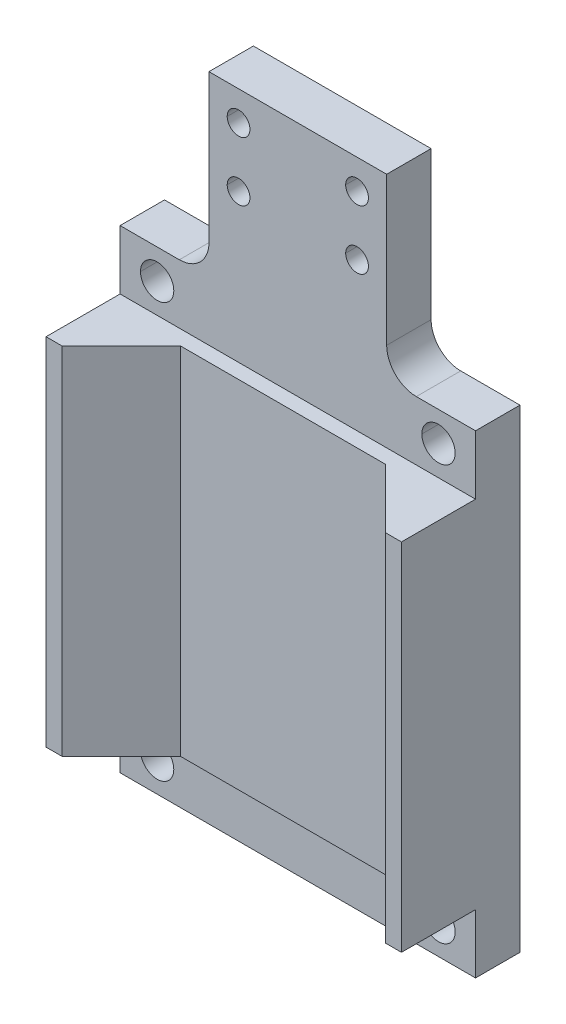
ISO-10303-21;
HEADER;
FILE_DESCRIPTION(('STEP AP214'),'2;1');
FILE_NAME('part.step','',(''),(''),'','','');
FILE_SCHEMA(('AUTOMOTIVE_DESIGN { 1 0 10303 214 1 1 1 1 }'));
ENDSEC;
DATA;
#1=APPLICATION_CONTEXT('core data for automotive mechanical design processes');
#2=APPLICATION_PROTOCOL_DEFINITION('international standard','automotive_design',2000,#1);
#3=PRODUCT_CONTEXT('',#1,'mechanical');
#4=PRODUCT('Part','Part','',(#3));
#5=PRODUCT_RELATED_PRODUCT_CATEGORY('part','',(#4));
#6=PRODUCT_DEFINITION_FORMATION('','',#4);
#7=PRODUCT_DEFINITION_CONTEXT('part definition',#1,'design');
#8=PRODUCT_DEFINITION('design','',#6,#7);
#9=PRODUCT_DEFINITION_SHAPE('','',#8);
#10=(LENGTH_UNIT() NAMED_UNIT(*) SI_UNIT(.MILLI.,.METRE.));
#11=(NAMED_UNIT(*) PLANE_ANGLE_UNIT() SI_UNIT($,.RADIAN.));
#12=(NAMED_UNIT(*) SI_UNIT($,.STERADIAN.) SOLID_ANGLE_UNIT());
#13=UNCERTAINTY_MEASURE_WITH_UNIT(LENGTH_MEASURE(1.E-05),#10,'distance_accuracy_value','');
#14=(GEOMETRIC_REPRESENTATION_CONTEXT(3) GLOBAL_UNCERTAINTY_ASSIGNED_CONTEXT((#13)) GLOBAL_UNIT_ASSIGNED_CONTEXT((#10,
#11,#12)) REPRESENTATION_CONTEXT('',''));
#15=CARTESIAN_POINT('',(0.,0.,0.));
#16=DIRECTION('',(0.,0.,1.));
#17=DIRECTION('',(1.,0.,0.));
#18=AXIS2_PLACEMENT_3D('',#15,#16,#17);
#19=CARTESIAN_POINT('',(21.9526280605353,19.0499999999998,1.80477854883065E-13));
#20=DIRECTION('',(-0.707106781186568,0.,0.707106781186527));
#21=DIRECTION('',(0.707106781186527,0.,0.707106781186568));
#22=AXIS2_PLACEMENT_3D('',#19,#20,#21);
#23=PLANE('',#22);
#24=DIRECTION('',(-0.707106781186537,0.,-0.707106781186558));
#25=VECTOR('',#24,1.);
#26=CARTESIAN_POINT('',(34.6526280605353,19.0499999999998,12.7000000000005));
#27=LINE('',#26,#25);
#28=CARTESIAN_POINT('',(34.6526280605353,19.0499999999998,12.7000000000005));
#29=VERTEX_POINT('',#28);
#30=CARTESIAN_POINT('',(21.9526280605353,19.0499999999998,1.81589928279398E-13));
#31=VERTEX_POINT('',#30);
#32=EDGE_CURVE('E258',#29,#31,#27,.T.);
#33=ORIENTED_EDGE('',*,*,#32,.T.);
#34=DIRECTION('',(0.,1.,0.));
#35=VECTOR('',#34,1.);
#36=CARTESIAN_POINT('',(21.9526280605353,19.0499999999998,1.80477854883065E-13));
#37=LINE('',#36,#35);
#38=CARTESIAN_POINT('',(21.9526280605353,-57.1500000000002,1.81589928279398E-13));
#39=VERTEX_POINT('',#38);
#40=EDGE_CURVE('E271',#39,#31,#37,.T.);
#41=ORIENTED_EDGE('',*,*,#40,.F.);
#42=DIRECTION('',(-0.707106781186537,0.,-0.707106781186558));
#43=VECTOR('',#42,1.);
#44=CARTESIAN_POINT('',(34.6526280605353,-57.1500000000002,12.7000000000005));
#45=LINE('',#44,#43);
#46=CARTESIAN_POINT('',(34.6526280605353,-57.1500000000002,12.7000000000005));
#47=VERTEX_POINT('',#46);
#48=EDGE_CURVE('E276',#47,#39,#45,.T.);
#49=ORIENTED_EDGE('',*,*,#48,.F.);
#50=DIRECTION('',(0.,1.,0.));
#51=VECTOR('',#50,1.);
#52=CARTESIAN_POINT('',(34.6526280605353,19.0499999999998,12.7000000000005));
#53=LINE('',#52,#51);
#54=EDGE_CURVE('E288',#29,#47,#53,.F.);
#55=ORIENTED_EDGE('',*,*,#54,.F.);
#56=EDGE_LOOP('',(#33,#41,#49,#55));
#57=FACE_BOUND('',#56,.T.);
#58=ADVANCED_FACE('F16',(#57),#23,.T.);
#59=CARTESIAN_POINT('',(-21.9526280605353,19.0499999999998,1.80477854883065E-13));
#60=DIRECTION('',(0.,0.,1.));
#61=DIRECTION('',(1.,0.,0.));
#62=AXIS2_PLACEMENT_3D('',#59,#60,#61);
#63=PLANE('',#62);
#64=DIRECTION('',(1.,0.,0.));
#65=VECTOR('',#64,1.);
#66=CARTESIAN_POINT('',(0.,19.0499999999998,1.80411241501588E-13));
#67=LINE('',#66,#65);
#68=CARTESIAN_POINT('',(-21.9526280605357,19.0499999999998,0.));
#69=VERTEX_POINT('',#68);
#70=EDGE_CURVE('E296',#31,#69,#67,.F.);
#71=ORIENTED_EDGE('',*,*,#70,.T.);
#72=DIRECTION('',(0.,1.,0.));
#73=VECTOR('',#72,1.);
#74=CARTESIAN_POINT('',(-21.9526280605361,19.0499999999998,-5.3776427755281E-13));
#75=LINE('',#74,#73);
#76=CARTESIAN_POINT('',(-21.9526280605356,-57.1500000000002,0.));
#77=VERTEX_POINT('',#76);
#78=EDGE_CURVE('E222',#77,#69,#75,.T.);
#79=ORIENTED_EDGE('',*,*,#78,.F.);
#80=DIRECTION('',(1.,0.,0.));
#81=VECTOR('',#80,1.);
#82=CARTESIAN_POINT('',(0.,-57.1500000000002,1.80411241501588E-13));
#83=LINE('',#82,#81);
#84=EDGE_CURVE('E266',#39,#77,#83,.F.);
#85=ORIENTED_EDGE('',*,*,#84,.F.);
#86=ORIENTED_EDGE('',*,*,#40,.T.);
#87=EDGE_LOOP('',(#71,#79,#85,#86));
#88=FACE_BOUND('',#87,.T.);
#89=ADVANCED_FACE('F801',(#88),#63,.T.);
#90=CARTESIAN_POINT('',(-34.6526280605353,19.0499999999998,12.7000000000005));
#91=DIRECTION('',(0.707106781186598,0.,0.707106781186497));
#92=DIRECTION('',(0.707106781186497,0.,-0.707106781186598));
#93=AXIS2_PLACEMENT_3D('',#90,#91,#92);
#94=PLANE('',#93);
#95=DIRECTION('',(-0.707106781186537,0.,0.707106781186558));
#96=VECTOR('',#95,1.);
#97=CARTESIAN_POINT('',(-21.9526280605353,19.0499999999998,1.80411241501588E-13));
#98=LINE('',#97,#96);
#99=CARTESIAN_POINT('',(-34.6526280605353,19.0499999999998,12.7000000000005));
#100=VERTEX_POINT('',#99);
#101=EDGE_CURVE('E299',#69,#100,#98,.T.);
#102=ORIENTED_EDGE('',*,*,#101,.T.);
#103=DIRECTION('',(0.,1.,0.));
#104=VECTOR('',#103,1.);
#105=CARTESIAN_POINT('',(-34.6526280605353,19.0499999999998,12.7000000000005));
#106=LINE('',#105,#104);
#107=CARTESIAN_POINT('',(-34.6526280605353,-57.1500000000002,12.7000000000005));
#108=VERTEX_POINT('',#107);
#109=EDGE_CURVE('E255',#108,#100,#106,.T.);
#110=ORIENTED_EDGE('',*,*,#109,.F.);
#111=DIRECTION('',(-0.707106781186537,0.,0.707106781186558));
#112=VECTOR('',#111,1.);
#113=CARTESIAN_POINT('',(-21.9526280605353,-57.1500000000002,1.80411241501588E-13));
#114=LINE('',#113,#112);
#115=EDGE_CURVE('E262',#77,#108,#114,.T.);
#116=ORIENTED_EDGE('',*,*,#115,.F.);
#117=ORIENTED_EDGE('',*,*,#78,.T.);
#118=EDGE_LOOP('',(#102,#110,#116,#117));
#119=FACE_BOUND('',#118,.T.);
#120=ADVANCED_FACE('F799',(#119),#94,.T.);
#121=CARTESIAN_POINT('',(-12.7,63.5000000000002,-1.27000000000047));
#122=DIRECTION('',(0.,0.,-1.));
#123=DIRECTION('',(-1.,0.,0.));
#124=AXIS2_PLACEMENT_3D('',#121,#122,#123);
#125=CYLINDRICAL_SURFACE('',#124,2.4384);
#126=CARTESIAN_POINT('',(-12.7,63.5000000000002,-3.17500000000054));
#127=DIRECTION('',(0.,0.,-1.));
#128=DIRECTION('',(-1.,0.,0.));
#129=AXIS2_PLACEMENT_3D('',#126,#127,#128);
#130=CIRCLE('',#129,2.4384);
#131=CARTESIAN_POINT('',(-10.2616,63.5000000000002,-3.17500000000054));
#132=VERTEX_POINT('',#131);
#133=CARTESIAN_POINT('',(-15.1384,63.5000000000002,-3.17500000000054));
#134=VERTEX_POINT('',#133);
#135=EDGE_CURVE('E220',#132,#134,#130,.T.);
#136=ORIENTED_EDGE('',*,*,#135,.F.);
#137=DIRECTION('',(0.,0.,-1.));
#138=VECTOR('',#137,1.);
#139=CARTESIAN_POINT('',(-10.2616,63.5000000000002,-1.27000000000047));
#140=LINE('',#139,#138);
#141=CARTESIAN_POINT('',(-10.2616,63.5000000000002,-7.62000000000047));
#142=VERTEX_POINT('',#141);
#143=EDGE_CURVE('E216',#132,#142,#140,.T.);
#144=ORIENTED_EDGE('',*,*,#143,.T.);
#145=CARTESIAN_POINT('',(-12.7,63.5000000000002,-7.62000000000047));
#146=DIRECTION('',(0.,0.,-1.));
#147=DIRECTION('',(-1.,0.,0.));
#148=AXIS2_PLACEMENT_3D('',#145,#146,#147);
#149=CIRCLE('',#148,2.4384);
#150=CARTESIAN_POINT('',(-15.1384,63.5000000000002,-7.62000000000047));
#151=VERTEX_POINT('',#150);
#152=EDGE_CURVE('E219',#142,#151,#149,.T.);
#153=ORIENTED_EDGE('',*,*,#152,.T.);
#154=DIRECTION('',(0.,0.,-1.));
#155=VECTOR('',#154,1.);
#156=CARTESIAN_POINT('',(-15.1384,63.5000000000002,-1.27000000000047));
#157=LINE('',#156,#155);
#158=EDGE_CURVE('E210',#151,#134,#157,.F.);
#159=ORIENTED_EDGE('',*,*,#158,.T.);
#160=EDGE_LOOP('',(#136,#144,#153,#159));
#161=FACE_BOUND('',#160,.T.);
#162=ADVANCED_FACE('F218',(#161),#125,.F.);
#163=CARTESIAN_POINT('',(-12.7,63.5000000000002,-1.27000000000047));
#164=DIRECTION('',(0.,0.,-1.));
#165=DIRECTION('',(-1.,0.,0.));
#166=AXIS2_PLACEMENT_3D('',#163,#164,#165);
#167=CYLINDRICAL_SURFACE('',#166,2.4384);
#168=CARTESIAN_POINT('',(-12.7,63.5000000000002,-7.62000000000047));
#169=DIRECTION('',(0.,0.,-1.));
#170=DIRECTION('',(-1.,0.,0.));
#171=AXIS2_PLACEMENT_3D('',#168,#169,#170);
#172=CIRCLE('',#171,2.4384);
#173=EDGE_CURVE('E19',#151,#142,#172,.T.);
#174=ORIENTED_EDGE('',*,*,#173,.T.);
#175=ORIENTED_EDGE('',*,*,#143,.F.);
#176=CARTESIAN_POINT('',(-12.7,63.5000000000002,-3.17500000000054));
#177=DIRECTION('',(0.,0.,-1.));
#178=DIRECTION('',(-1.,0.,0.));
#179=AXIS2_PLACEMENT_3D('',#176,#177,#178);
#180=CIRCLE('',#179,2.4384);
#181=EDGE_CURVE('E449',#134,#132,#180,.T.);
#182=ORIENTED_EDGE('',*,*,#181,.F.);
#183=ORIENTED_EDGE('',*,*,#158,.F.);
#184=EDGE_LOOP('',(#174,#175,#182,#183));
#185=FACE_BOUND('',#184,.T.);
#186=ADVANCED_FACE('F228',(#185),#167,.F.);
#187=CARTESIAN_POINT('',(-12.7,50.7999999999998,-1.27000000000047));
#188=DIRECTION('',(0.,0.,1.));
#189=DIRECTION('',(1.,0.,0.));
#190=AXIS2_PLACEMENT_3D('',#187,#188,#189);
#191=CYLINDRICAL_SURFACE('',#190,2.4384);
#192=CARTESIAN_POINT('',(-12.7,50.7999999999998,-3.17500000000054));
#193=DIRECTION('',(0.,0.,1.));
#194=DIRECTION('',(1.,0.,0.));
#195=AXIS2_PLACEMENT_3D('',#192,#193,#194);
#196=CIRCLE('',#195,2.4384);
#197=CARTESIAN_POINT('',(-10.2616,50.7999999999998,-3.17500000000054));
#198=VERTEX_POINT('',#197);
#199=CARTESIAN_POINT('',(-15.1384,50.7999999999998,-3.17500000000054));
#200=VERTEX_POINT('',#199);
#201=EDGE_CURVE('E447',#198,#200,#196,.F.);
#202=ORIENTED_EDGE('',*,*,#201,.F.);
#203=DIRECTION('',(0.,0.,1.));
#204=VECTOR('',#203,1.);
#205=CARTESIAN_POINT('',(-10.2616,50.7999999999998,-1.27000000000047));
#206=LINE('',#205,#204);
#207=CARTESIAN_POINT('',(-10.2616,50.7999999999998,-7.62000000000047));
#208=VERTEX_POINT('',#207);
#209=EDGE_CURVE('E251',#198,#208,#206,.F.);
#210=ORIENTED_EDGE('',*,*,#209,.T.);
#211=CARTESIAN_POINT('',(-12.7,50.7999999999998,-7.62000000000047));
#212=DIRECTION('',(0.,0.,1.));
#213=DIRECTION('',(1.,0.,0.));
#214=AXIS2_PLACEMENT_3D('',#211,#212,#213);
#215=CIRCLE('',#214,2.4384);
#216=CARTESIAN_POINT('',(-15.1384,50.7999999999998,-7.62000000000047));
#217=VERTEX_POINT('',#216);
#218=EDGE_CURVE('E227',#208,#217,#215,.F.);
#219=ORIENTED_EDGE('',*,*,#218,.T.);
#220=DIRECTION('',(0.,0.,1.));
#221=VECTOR('',#220,1.);
#222=CARTESIAN_POINT('',(-15.1384,50.7999999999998,-1.27000000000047));
#223=LINE('',#222,#221);
#224=EDGE_CURVE('E248',#217,#200,#223,.T.);
#225=ORIENTED_EDGE('',*,*,#224,.T.);
#226=EDGE_LOOP('',(#202,#210,#219,#225));
#227=FACE_BOUND('',#226,.T.);
#228=ADVANCED_FACE('F469',(#227),#191,.F.);
#229=CARTESIAN_POINT('',(-12.7,50.7999999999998,-1.27000000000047));
#230=DIRECTION('',(0.,0.,1.));
#231=DIRECTION('',(1.,0.,0.));
#232=AXIS2_PLACEMENT_3D('',#229,#230,#231);
#233=CYLINDRICAL_SURFACE('',#232,2.4384);
#234=CARTESIAN_POINT('',(-12.7,50.7999999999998,-7.62000000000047));
#235=DIRECTION('',(0.,0.,1.));
#236=DIRECTION('',(1.,0.,0.));
#237=AXIS2_PLACEMENT_3D('',#234,#235,#236);
#238=CIRCLE('',#237,2.4384);
#239=EDGE_CURVE('E463',#217,#208,#238,.F.);
#240=ORIENTED_EDGE('',*,*,#239,.T.);
#241=ORIENTED_EDGE('',*,*,#209,.F.);
#242=CARTESIAN_POINT('',(-12.7,50.7999999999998,-3.17500000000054));
#243=DIRECTION('',(0.,0.,1.));
#244=DIRECTION('',(1.,0.,0.));
#245=AXIS2_PLACEMENT_3D('',#242,#243,#244);
#246=CIRCLE('',#245,2.4384);
#247=EDGE_CURVE('E444',#200,#198,#246,.F.);
#248=ORIENTED_EDGE('',*,*,#247,.F.);
#249=ORIENTED_EDGE('',*,*,#224,.F.);
#250=EDGE_LOOP('',(#240,#241,#248,#249));
#251=FACE_BOUND('',#250,.T.);
#252=ADVANCED_FACE('F476',(#251),#233,.F.);
#253=CARTESIAN_POINT('',(12.7,50.7999999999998,-1.27000000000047));
#254=DIRECTION('',(0.,0.,-1.));
#255=DIRECTION('',(-1.,0.,0.));
#256=AXIS2_PLACEMENT_3D('',#253,#254,#255);
#257=CYLINDRICAL_SURFACE('',#256,2.4384);
#258=CARTESIAN_POINT('',(12.7,50.7999999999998,-3.17500000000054));
#259=DIRECTION('',(0.,0.,-1.));
#260=DIRECTION('',(-1.,0.,0.));
#261=AXIS2_PLACEMENT_3D('',#258,#259,#260);
#262=CIRCLE('',#261,2.4384);
#263=CARTESIAN_POINT('',(10.2616,50.7999999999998,-3.17500000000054));
#264=VERTEX_POINT('',#263);
#265=CARTESIAN_POINT('',(15.1384,50.7999999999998,-3.17500000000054));
#266=VERTEX_POINT('',#265);
#267=EDGE_CURVE('E442',#264,#266,#262,.T.);
#268=ORIENTED_EDGE('',*,*,#267,.F.);
#269=DIRECTION('',(0.,0.,-1.));
#270=VECTOR('',#269,1.);
#271=CARTESIAN_POINT('',(10.2616,50.7999999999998,-1.27000000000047));
#272=LINE('',#271,#270);
#273=CARTESIAN_POINT('',(10.2616,50.7999999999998,-7.62000000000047));
#274=VERTEX_POINT('',#273);
#275=EDGE_CURVE('E246',#264,#274,#272,.T.);
#276=ORIENTED_EDGE('',*,*,#275,.T.);
#277=CARTESIAN_POINT('',(12.7,50.7999999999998,-7.62000000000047));
#278=DIRECTION('',(0.,0.,-1.));
#279=DIRECTION('',(-1.,0.,0.));
#280=AXIS2_PLACEMENT_3D('',#277,#278,#279);
#281=CIRCLE('',#280,2.4384);
#282=CARTESIAN_POINT('',(15.1384,50.7999999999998,-7.62000000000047));
#283=VERTEX_POINT('',#282);
#284=EDGE_CURVE('E457',#274,#283,#281,.T.);
#285=ORIENTED_EDGE('',*,*,#284,.T.);
#286=DIRECTION('',(0.,0.,-1.));
#287=VECTOR('',#286,1.);
#288=CARTESIAN_POINT('',(15.1384,50.7999999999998,-1.27000000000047));
#289=LINE('',#288,#287);
#290=EDGE_CURVE('E238',#283,#266,#289,.F.);
#291=ORIENTED_EDGE('',*,*,#290,.T.);
#292=EDGE_LOOP('',(#268,#276,#285,#291));
#293=FACE_BOUND('',#292,.T.);
#294=ADVANCED_FACE('F786',(#293),#257,.F.);
#295=CARTESIAN_POINT('',(12.7,50.7999999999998,-1.27000000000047));
#296=DIRECTION('',(0.,0.,-1.));
#297=DIRECTION('',(-1.,0.,0.));
#298=AXIS2_PLACEMENT_3D('',#295,#296,#297);
#299=CYLINDRICAL_SURFACE('',#298,2.4384);
#300=CARTESIAN_POINT('',(12.7,50.7999999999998,-7.62000000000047));
#301=DIRECTION('',(0.,0.,-1.));
#302=DIRECTION('',(-1.,0.,0.));
#303=AXIS2_PLACEMENT_3D('',#300,#301,#302);
#304=CIRCLE('',#303,2.4384);
#305=EDGE_CURVE('E460',#283,#274,#304,.T.);
#306=ORIENTED_EDGE('',*,*,#305,.T.);
#307=ORIENTED_EDGE('',*,*,#275,.F.);
#308=CARTESIAN_POINT('',(12.7,50.7999999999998,-3.17500000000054));
#309=DIRECTION('',(0.,0.,-1.));
#310=DIRECTION('',(-1.,0.,0.));
#311=AXIS2_PLACEMENT_3D('',#308,#309,#310);
#312=CIRCLE('',#311,2.4384);
#313=EDGE_CURVE('E439',#266,#264,#312,.T.);
#314=ORIENTED_EDGE('',*,*,#313,.F.);
#315=ORIENTED_EDGE('',*,*,#290,.F.);
#316=EDGE_LOOP('',(#306,#307,#314,#315));
#317=FACE_BOUND('',#316,.T.);
#318=ADVANCED_FACE('F783',(#317),#299,.F.);
#319=CARTESIAN_POINT('',(12.7,63.5000000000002,-1.27000000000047));
#320=DIRECTION('',(0.,0.,1.));
#321=DIRECTION('',(1.,0.,0.));
#322=AXIS2_PLACEMENT_3D('',#319,#320,#321);
#323=CYLINDRICAL_SURFACE('',#322,2.4384);
#324=CARTESIAN_POINT('',(12.7,63.5000000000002,-3.17500000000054));
#325=DIRECTION('',(0.,0.,1.));
#326=DIRECTION('',(1.,0.,0.));
#327=AXIS2_PLACEMENT_3D('',#324,#325,#326);
#328=CIRCLE('',#327,2.4384);
#329=CARTESIAN_POINT('',(10.2616,63.5000000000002,-3.17500000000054));
#330=VERTEX_POINT('',#329);
#331=CARTESIAN_POINT('',(15.1384,63.5000000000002,-3.17500000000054));
#332=VERTEX_POINT('',#331);
#333=EDGE_CURVE('E437',#330,#332,#328,.F.);
#334=ORIENTED_EDGE('',*,*,#333,.F.);
#335=DIRECTION('',(0.,0.,1.));
#336=VECTOR('',#335,1.);
#337=CARTESIAN_POINT('',(10.2616,63.5000000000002,-1.27000000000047));
#338=LINE('',#337,#336);
#339=CARTESIAN_POINT('',(10.2616,63.5000000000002,-7.62000000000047));
#340=VERTEX_POINT('',#339);
#341=EDGE_CURVE('E231',#330,#340,#338,.F.);
#342=ORIENTED_EDGE('',*,*,#341,.T.);
#343=CARTESIAN_POINT('',(12.7,63.5000000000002,-7.62000000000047));
#344=DIRECTION('',(0.,0.,1.));
#345=DIRECTION('',(1.,0.,0.));
#346=AXIS2_PLACEMENT_3D('',#343,#344,#345);
#347=CIRCLE('',#346,2.4384);
#348=CARTESIAN_POINT('',(15.1384,63.5000000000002,-7.62000000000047));
#349=VERTEX_POINT('',#348);
#350=EDGE_CURVE('E455',#340,#349,#347,.F.);
#351=ORIENTED_EDGE('',*,*,#350,.T.);
#352=DIRECTION('',(0.,0.,1.));
#353=VECTOR('',#352,1.);
#354=CARTESIAN_POINT('',(15.1384,63.5000000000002,-1.27000000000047));
#355=LINE('',#354,#353);
#356=EDGE_CURVE('E229',#349,#332,#355,.T.);
#357=ORIENTED_EDGE('',*,*,#356,.T.);
#358=EDGE_LOOP('',(#334,#342,#351,#357));
#359=FACE_BOUND('',#358,.T.);
#360=ADVANCED_FACE('F779',(#359),#323,.F.);
#361=CARTESIAN_POINT('',(12.7,63.5000000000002,-1.27000000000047));
#362=DIRECTION('',(0.,0.,1.));
#363=DIRECTION('',(1.,0.,0.));
#364=AXIS2_PLACEMENT_3D('',#361,#362,#363);
#365=CYLINDRICAL_SURFACE('',#364,2.4384);
#366=CARTESIAN_POINT('',(12.7,63.5000000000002,-7.62000000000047));
#367=DIRECTION('',(0.,0.,1.));
#368=DIRECTION('',(1.,0.,0.));
#369=AXIS2_PLACEMENT_3D('',#366,#367,#368);
#370=CIRCLE('',#369,2.4384);
#371=EDGE_CURVE('E259',#349,#340,#370,.F.);
#372=ORIENTED_EDGE('',*,*,#371,.T.);
#373=ORIENTED_EDGE('',*,*,#341,.F.);
#374=CARTESIAN_POINT('',(12.7,63.5000000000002,-3.17500000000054));
#375=DIRECTION('',(0.,0.,1.));
#376=DIRECTION('',(1.,0.,0.));
#377=AXIS2_PLACEMENT_3D('',#374,#375,#376);
#378=CIRCLE('',#377,2.4384);
#379=EDGE_CURVE('E434',#332,#330,#378,.F.);
#380=ORIENTED_EDGE('',*,*,#379,.F.);
#381=ORIENTED_EDGE('',*,*,#356,.F.);
#382=EDGE_LOOP('',(#372,#373,#380,#381));
#383=FACE_BOUND('',#382,.T.);
#384=ADVANCED_FACE('F773',(#383),#365,.F.);
#385=CARTESIAN_POINT('',(-12.7,63.5000000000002,-7.62000000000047));
#386=DIRECTION('',(0.,0.,1.));
#387=DIRECTION('',(1.,0.,0.));
#388=AXIS2_PLACEMENT_3D('',#385,#386,#387);
#389=PLANE('',#388);
#390=ORIENTED_EDGE('',*,*,#173,.F.);
#391=ORIENTED_EDGE('',*,*,#152,.F.);
#392=EDGE_LOOP('',(#390,#391));
#393=FACE_BOUND('',#392,.T.);
#394=CARTESIAN_POINT('',(-12.7,63.5000000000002,-7.62000000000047));
#395=DIRECTION('',(0.,0.,-1.));
#396=DIRECTION('',(-1.,0.,0.));
#397=AXIS2_PLACEMENT_3D('',#394,#395,#396);
#398=CIRCLE('',#397,4.7625);
#399=CARTESIAN_POINT('',(-7.9375,63.5000000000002,-7.62000000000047));
#400=VERTEX_POINT('',#399);
#401=CARTESIAN_POINT('',(-17.4625,63.5000000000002,-7.62000000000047));
#402=VERTEX_POINT('',#401);
#403=EDGE_CURVE('E427',#400,#402,#398,.T.);
#404=ORIENTED_EDGE('',*,*,#403,.T.);
#405=CARTESIAN_POINT('',(-12.7,63.5000000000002,-7.62000000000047));
#406=DIRECTION('',(0.,0.,-1.));
#407=DIRECTION('',(-1.,0.,0.));
#408=AXIS2_PLACEMENT_3D('',#405,#406,#407);
#409=CIRCLE('',#408,4.7625);
#410=EDGE_CURVE('E431',#402,#400,#409,.T.);
#411=ORIENTED_EDGE('',*,*,#410,.T.);
#412=EDGE_LOOP('',(#404,#411));
#413=FACE_BOUND('',#412,.T.);
#414=ADVANCED_FACE('F225',(#393,#413),#389,.F.);
#415=CARTESIAN_POINT('',(-12.7,50.7999999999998,-7.62000000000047));
#416=DIRECTION('',(0.,0.,1.));
#417=DIRECTION('',(1.,0.,0.));
#418=AXIS2_PLACEMENT_3D('',#415,#416,#417);
#419=PLANE('',#418);
#420=ORIENTED_EDGE('',*,*,#218,.F.);
#421=ORIENTED_EDGE('',*,*,#239,.F.);
#422=EDGE_LOOP('',(#420,#421));
#423=FACE_BOUND('',#422,.T.);
#424=CARTESIAN_POINT('',(-12.7,50.7999999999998,-7.62000000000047));
#425=DIRECTION('',(0.,0.,1.));
#426=DIRECTION('',(1.,0.,0.));
#427=AXIS2_PLACEMENT_3D('',#424,#425,#426);
#428=CIRCLE('',#427,4.7625);
#429=CARTESIAN_POINT('',(-17.4625,50.7999999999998,-7.62000000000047));
#430=VERTEX_POINT('',#429);
#431=CARTESIAN_POINT('',(-7.9375,50.7999999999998,-7.62000000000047));
#432=VERTEX_POINT('',#431);
#433=EDGE_CURVE('E424',#430,#432,#428,.F.);
#434=ORIENTED_EDGE('',*,*,#433,.T.);
#435=CARTESIAN_POINT('',(-12.7,50.7999999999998,-7.62000000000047));
#436=DIRECTION('',(0.,0.,1.));
#437=DIRECTION('',(1.,0.,0.));
#438=AXIS2_PLACEMENT_3D('',#435,#436,#437);
#439=CIRCLE('',#438,4.7625);
#440=EDGE_CURVE('E420',#432,#430,#439,.F.);
#441=ORIENTED_EDGE('',*,*,#440,.T.);
#442=EDGE_LOOP('',(#434,#441));
#443=FACE_BOUND('',#442,.T.);
#444=ADVANCED_FACE('F473',(#423,#443),#419,.F.);
#445=CARTESIAN_POINT('',(12.7,50.7999999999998,-7.62000000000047));
#446=DIRECTION('',(0.,0.,1.));
#447=DIRECTION('',(1.,0.,0.));
#448=AXIS2_PLACEMENT_3D('',#445,#446,#447);
#449=PLANE('',#448);
#450=ORIENTED_EDGE('',*,*,#305,.F.);
#451=ORIENTED_EDGE('',*,*,#284,.F.);
#452=EDGE_LOOP('',(#450,#451));
#453=FACE_BOUND('',#452,.T.);
#454=CARTESIAN_POINT('',(12.7,50.7999999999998,-7.62000000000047));
#455=DIRECTION('',(0.,0.,-1.));
#456=DIRECTION('',(-1.,0.,0.));
#457=AXIS2_PLACEMENT_3D('',#454,#455,#456);
#458=CIRCLE('',#457,4.7625);
#459=CARTESIAN_POINT('',(7.9375,50.7999999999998,-7.62000000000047));
#460=VERTEX_POINT('',#459);
#461=CARTESIAN_POINT('',(17.4625,50.7999999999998,-7.62000000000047));
#462=VERTEX_POINT('',#461);
#463=EDGE_CURVE('E413',#460,#462,#458,.T.);
#464=ORIENTED_EDGE('',*,*,#463,.T.);
#465=CARTESIAN_POINT('',(12.7,50.7999999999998,-7.62000000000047));
#466=DIRECTION('',(0.,0.,-1.));
#467=DIRECTION('',(-1.,0.,0.));
#468=AXIS2_PLACEMENT_3D('',#465,#466,#467);
#469=CIRCLE('',#468,4.7625);
#470=EDGE_CURVE('E417',#462,#460,#469,.T.);
#471=ORIENTED_EDGE('',*,*,#470,.T.);
#472=EDGE_LOOP('',(#464,#471));
#473=FACE_BOUND('',#472,.T.);
#474=ADVANCED_FACE('F764',(#453,#473),#449,.F.);
#475=CARTESIAN_POINT('',(12.7,63.5000000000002,-7.62000000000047));
#476=DIRECTION('',(0.,0.,1.));
#477=DIRECTION('',(1.,0.,0.));
#478=AXIS2_PLACEMENT_3D('',#475,#476,#477);
#479=PLANE('',#478);
#480=ORIENTED_EDGE('',*,*,#350,.F.);
#481=ORIENTED_EDGE('',*,*,#371,.F.);
#482=EDGE_LOOP('',(#480,#481));
#483=FACE_BOUND('',#482,.T.);
#484=CARTESIAN_POINT('',(12.7,63.5000000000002,-7.62000000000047));
#485=DIRECTION('',(0.,0.,1.));
#486=DIRECTION('',(1.,0.,0.));
#487=AXIS2_PLACEMENT_3D('',#484,#485,#486);
#488=CIRCLE('',#487,4.7625);
#489=CARTESIAN_POINT('',(17.4625,63.5000000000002,-7.62000000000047));
#490=VERTEX_POINT('',#489);
#491=CARTESIAN_POINT('',(7.9375,63.5000000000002,-7.62000000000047));
#492=VERTEX_POINT('',#491);
#493=EDGE_CURVE('E410',#490,#492,#488,.F.);
#494=ORIENTED_EDGE('',*,*,#493,.T.);
#495=CARTESIAN_POINT('',(12.7,63.5000000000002,-7.62000000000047));
#496=DIRECTION('',(0.,0.,1.));
#497=DIRECTION('',(1.,0.,0.));
#498=AXIS2_PLACEMENT_3D('',#495,#496,#497);
#499=CIRCLE('',#498,4.7625);
#500=EDGE_CURVE('E406',#492,#490,#499,.F.);
#501=ORIENTED_EDGE('',*,*,#500,.T.);
#502=EDGE_LOOP('',(#494,#501));
#503=FACE_BOUND('',#502,.T.);
#504=ADVANCED_FACE('F770',(#483,#503),#479,.F.);
#505=CARTESIAN_POINT('',(-38.1,19.0499999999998,12.7000000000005));
#506=DIRECTION('',(0.,0.,1.));
#507=DIRECTION('',(1.,0.,0.));
#508=AXIS2_PLACEMENT_3D('',#505,#506,#507);
#509=PLANE('',#508);
#510=DIRECTION('',(1.,0.,0.));
#511=VECTOR('',#510,1.);
#512=CARTESIAN_POINT('',(0.,19.0499999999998,12.7000000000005));
#513=LINE('',#512,#511);
#514=CARTESIAN_POINT('',(-38.1,19.0499999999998,12.7000000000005));
#515=VERTEX_POINT('',#514);
#516=EDGE_CURVE('E302',#100,#515,#513,.F.);
#517=ORIENTED_EDGE('',*,*,#516,.T.);
#518=DIRECTION('',(0.,-1.,0.));
#519=VECTOR('',#518,1.);
#520=CARTESIAN_POINT('',(-38.1,-69.8500000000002,12.7000000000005));
#521=LINE('',#520,#519);
#522=CARTESIAN_POINT('',(-38.1,-57.1500000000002,12.7000000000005));
#523=VERTEX_POINT('',#522);
#524=EDGE_CURVE('E700',#523,#515,#521,.F.);
#525=ORIENTED_EDGE('',*,*,#524,.F.);
#526=DIRECTION('',(1.,0.,0.));
#527=VECTOR('',#526,1.);
#528=CARTESIAN_POINT('',(0.,-57.1500000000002,12.7000000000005));
#529=LINE('',#528,#527);
#530=EDGE_CURVE('E265',#108,#523,#529,.F.);
#531=ORIENTED_EDGE('',*,*,#530,.F.);
#532=ORIENTED_EDGE('',*,*,#109,.T.);
#533=EDGE_LOOP('',(#517,#525,#531,#532));
#534=FACE_BOUND('',#533,.T.);
#535=ADVANCED_FACE('F868',(#534),#509,.T.);
#536=CARTESIAN_POINT('',(0.,19.0499999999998,-7.93750000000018));
#537=DIRECTION('',(0.,-1.,0.));
#538=DIRECTION('',(1.,0.,0.));
#539=AXIS2_PLACEMENT_3D('',#536,#537,#538);
#540=PLANE('',#539);
#541=DIRECTION('',(0.,0.,1.));
#542=VECTOR('',#541,1.);
#543=CARTESIAN_POINT('',(-38.1,19.0499999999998,-12.7000000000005));
#544=LINE('',#543,#542);
#545=CARTESIAN_POINT('',(-38.1,19.0499999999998,-3.17500000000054));
#546=VERTEX_POINT('',#545);
#547=EDGE_CURVE('E695',#515,#546,#544,.F.);
#548=ORIENTED_EDGE('',*,*,#547,.F.);
#549=ORIENTED_EDGE('',*,*,#516,.F.);
#550=ORIENTED_EDGE('',*,*,#101,.F.);
#551=ORIENTED_EDGE('',*,*,#70,.F.);
#552=ORIENTED_EDGE('',*,*,#32,.F.);
#553=DIRECTION('',(1.,0.,0.));
#554=VECTOR('',#553,1.);
#555=CARTESIAN_POINT('',(34.6526280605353,19.0499999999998,12.7000000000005));
#556=LINE('',#555,#554);
#557=CARTESIAN_POINT('',(38.1,19.0499999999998,12.7000000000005));
#558=VERTEX_POINT('',#557);
#559=EDGE_CURVE('E291',#558,#29,#556,.F.);
#560=ORIENTED_EDGE('',*,*,#559,.F.);
#561=DIRECTION('',(0.,0.,1.));
#562=VECTOR('',#561,1.);
#563=CARTESIAN_POINT('',(38.1,19.0499999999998,-12.7000000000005));
#564=LINE('',#563,#562);
#565=CARTESIAN_POINT('',(38.1,19.0499999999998,-3.17500000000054));
#566=VERTEX_POINT('',#565);
#567=EDGE_CURVE('E635',#566,#558,#564,.T.);
#568=ORIENTED_EDGE('',*,*,#567,.F.);
#569=DIRECTION('',(1.,0.,0.));
#570=VECTOR('',#569,1.);
#571=CARTESIAN_POINT('',(23.8125,19.0499999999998,-3.17500000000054));
#572=LINE('',#571,#570);
#573=EDGE_CURVE('E433',#546,#566,#572,.T.);
#574=ORIENTED_EDGE('',*,*,#573,.F.);
#575=EDGE_LOOP('',(#548,#549,#550,#551,#552,#560,#568,#574));
#576=FACE_BOUND('',#575,.T.);
#577=ADVANCED_FACE('F822',(#576),#540,.F.);
#578=CARTESIAN_POINT('',(34.6526280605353,19.0499999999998,12.7000000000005));
#579=DIRECTION('',(0.,0.,1.));
#580=DIRECTION('',(1.,0.,0.));
#581=AXIS2_PLACEMENT_3D('',#578,#579,#580);
#582=PLANE('',#581);
#583=ORIENTED_EDGE('',*,*,#559,.T.);
#584=ORIENTED_EDGE('',*,*,#54,.T.);
#585=DIRECTION('',(1.,0.,0.));
#586=VECTOR('',#585,1.);
#587=CARTESIAN_POINT('',(0.,-57.1500000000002,12.7000000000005));
#588=LINE('',#587,#586);
#589=CARTESIAN_POINT('',(38.1,-57.1500000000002,12.7000000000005));
#590=VERTEX_POINT('',#589);
#591=EDGE_CURVE('E285',#590,#47,#588,.F.);
#592=ORIENTED_EDGE('',*,*,#591,.F.);
#593=DIRECTION('',(0.,1.,0.));
#594=VECTOR('',#593,1.);
#595=CARTESIAN_POINT('',(38.1,31.7499999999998,12.7000000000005));
#596=LINE('',#595,#594);
#597=EDGE_CURVE('E657',#558,#590,#596,.F.);
#598=ORIENTED_EDGE('',*,*,#597,.F.);
#599=EDGE_LOOP('',(#583,#584,#592,#598));
#600=FACE_BOUND('',#599,.T.);
#601=ADVANCED_FACE('F834',(#600),#582,.T.);
#602=CARTESIAN_POINT('',(0.,-57.1500000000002,-7.93750000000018));
#603=DIRECTION('',(0.,-1.,0.));
#604=DIRECTION('',(1.,0.,0.));
#605=AXIS2_PLACEMENT_3D('',#602,#603,#604);
#606=PLANE('',#605);
#607=ORIENTED_EDGE('',*,*,#530,.T.);
#608=DIRECTION('',(0.,0.,1.));
#609=VECTOR('',#608,1.);
#610=CARTESIAN_POINT('',(-38.1,-57.1500000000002,-12.7000000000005));
#611=LINE('',#610,#609);
#612=CARTESIAN_POINT('',(-38.1,-57.1500000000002,-3.17500000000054));
#613=VERTEX_POINT('',#612);
#614=EDGE_CURVE('E683',#613,#523,#611,.T.);
#615=ORIENTED_EDGE('',*,*,#614,.F.);
#616=DIRECTION('',(1.,0.,0.));
#617=VECTOR('',#616,1.);
#618=CARTESIAN_POINT('',(23.8125,-57.1500000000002,-3.17500000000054));
#619=LINE('',#618,#617);
#620=CARTESIAN_POINT('',(38.1,-57.1500000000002,-3.17500000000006));
#621=VERTEX_POINT('',#620);
#622=EDGE_CURVE('E452',#621,#613,#619,.F.);
#623=ORIENTED_EDGE('',*,*,#622,.F.);
#624=DIRECTION('',(0.,0.,1.));
#625=VECTOR('',#624,1.);
#626=CARTESIAN_POINT('',(38.1,-57.1500000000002,-12.7000000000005));
#627=LINE('',#626,#625);
#628=EDGE_CURVE('E648',#590,#621,#627,.F.);
#629=ORIENTED_EDGE('',*,*,#628,.F.);
#630=ORIENTED_EDGE('',*,*,#591,.T.);
#631=ORIENTED_EDGE('',*,*,#48,.T.);
#632=ORIENTED_EDGE('',*,*,#84,.T.);
#633=ORIENTED_EDGE('',*,*,#115,.T.);
#634=EDGE_LOOP('',(#607,#615,#623,#629,#630,#631,#632,#633));
#635=FACE_BOUND('',#634,.T.);
#636=ADVANCED_FACE('F493',(#635),#606,.T.);
#637=CARTESIAN_POINT('',(23.8125,69.8500000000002,-3.17500000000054));
#638=DIRECTION('',(0.,0.,1.));
#639=DIRECTION('',(1.,0.,0.));
#640=AXIS2_PLACEMENT_3D('',#637,#638,#639);
#641=PLANE('',#640);
#642=DIRECTION('',(1.,0.,0.));
#643=VECTOR('',#642,1.);
#644=CARTESIAN_POINT('',(38.1,-69.8500000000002,-3.17500000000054));
#645=LINE('',#644,#643);
#646=CARTESIAN_POINT('',(38.1,-69.8500000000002,-3.17500000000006));
#647=VERTEX_POINT('',#646);
#648=CARTESIAN_POINT('',(-38.1,-69.8500000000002,-3.17500000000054));
#649=VERTEX_POINT('',#648);
#650=EDGE_CURVE('E639',#647,#649,#645,.F.);
#651=ORIENTED_EDGE('',*,*,#650,.F.);
#652=DIRECTION('',(0.,1.,0.));
#653=VECTOR('',#652,1.);
#654=CARTESIAN_POINT('',(38.1,31.7499999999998,-3.17499999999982));
#655=LINE('',#654,#653);
#656=EDGE_CURVE('E645',#621,#647,#655,.F.);
#657=ORIENTED_EDGE('',*,*,#656,.F.);
#658=ORIENTED_EDGE('',*,*,#622,.T.);
#659=DIRECTION('',(0.,-1.,0.));
#660=VECTOR('',#659,1.);
#661=CARTESIAN_POINT('',(-38.1,-69.8500000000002,-3.17500000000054));
#662=LINE('',#661,#660);
#663=EDGE_CURVE('E680',#649,#613,#662,.F.);
#664=ORIENTED_EDGE('',*,*,#663,.F.);
#665=EDGE_LOOP('',(#651,#657,#658,#664));
#666=FACE_BOUND('',#665,.T.);
#667=CARTESIAN_POINT('',(-30.1625,-63.5000000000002,-3.17500000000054));
#668=DIRECTION('',(0.,0.,-1.));
#669=DIRECTION('',(-1.,0.,0.));
#670=AXIS2_PLACEMENT_3D('',#667,#668,#669);
#671=CIRCLE('',#670,3.571875);
#672=CARTESIAN_POINT('',(-33.734375,-63.5000000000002,-3.17500000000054));
#673=VERTEX_POINT('',#672);
#674=CARTESIAN_POINT('',(-26.590625,-63.5000000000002,-3.17500000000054));
#675=VERTEX_POINT('',#674);
#676=EDGE_CURVE('E398',#673,#675,#671,.T.);
#677=ORIENTED_EDGE('',*,*,#676,.T.);
#678=CARTESIAN_POINT('',(-30.1625,-63.5000000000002,-3.17500000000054));
#679=DIRECTION('',(0.,0.,-1.));
#680=DIRECTION('',(-1.,0.,0.));
#681=AXIS2_PLACEMENT_3D('',#678,#679,#680);
#682=CIRCLE('',#681,3.571875);
#683=EDGE_CURVE('E402',#675,#673,#682,.T.);
#684=ORIENTED_EDGE('',*,*,#683,.T.);
#685=EDGE_LOOP('',(#677,#684));
#686=FACE_BOUND('',#685,.T.);
#687=CARTESIAN_POINT('',(30.1625,-63.5000000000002,-3.17500000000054));
#688=DIRECTION('',(0.,0.,1.));
#689=DIRECTION('',(1.,0.,0.));
#690=AXIS2_PLACEMENT_3D('',#687,#688,#689);
#691=CIRCLE('',#690,3.571875);
#692=CARTESIAN_POINT('',(33.734375,-63.5000000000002,-3.17500000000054));
#693=VERTEX_POINT('',#692);
#694=CARTESIAN_POINT('',(26.590625,-63.5000000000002,-3.17500000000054));
#695=VERTEX_POINT('',#694);
#696=EDGE_CURVE('E390',#693,#695,#691,.F.);
#697=ORIENTED_EDGE('',*,*,#696,.T.);
#698=CARTESIAN_POINT('',(30.1625,-63.5000000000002,-3.17500000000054));
#699=DIRECTION('',(0.,0.,1.));
#700=DIRECTION('',(1.,0.,0.));
#701=AXIS2_PLACEMENT_3D('',#698,#699,#700);
#702=CIRCLE('',#701,3.571875);
#703=EDGE_CURVE('E394',#695,#693,#702,.F.);
#704=ORIENTED_EDGE('',*,*,#703,.T.);
#705=EDGE_LOOP('',(#697,#704));
#706=FACE_BOUND('',#705,.T.);
#707=ADVANCED_FACE('F482',(#666,#686,#706),#641,.T.);
#708=CARTESIAN_POINT('',(23.8125,69.8500000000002,-3.17500000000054));
#709=DIRECTION('',(0.,0.,1.));
#710=DIRECTION('',(1.,0.,0.));
#711=AXIS2_PLACEMENT_3D('',#708,#709,#710);
#712=PLANE('',#711);
#713=CARTESIAN_POINT('',(-30.1625,25.3999999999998,-3.17500000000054));
#714=DIRECTION('',(0.,0.,1.));
#715=DIRECTION('',(1.,0.,0.));
#716=AXIS2_PLACEMENT_3D('',#713,#714,#715);
#717=CIRCLE('',#716,3.571875);
#718=CARTESIAN_POINT('',(-33.734375,25.3999999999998,-3.17500000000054));
#719=VERTEX_POINT('',#718);
#720=CARTESIAN_POINT('',(-26.590625,25.3999999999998,-3.17500000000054));
#721=VERTEX_POINT('',#720);
#722=EDGE_CURVE('E382',#719,#721,#717,.F.);
#723=ORIENTED_EDGE('',*,*,#722,.T.);
#724=CARTESIAN_POINT('',(-30.1625,25.3999999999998,-3.17500000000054));
#725=DIRECTION('',(0.,0.,1.));
#726=DIRECTION('',(1.,0.,0.));
#727=AXIS2_PLACEMENT_3D('',#724,#725,#726);
#728=CIRCLE('',#727,3.571875);
#729=EDGE_CURVE('E386',#721,#719,#728,.F.);
#730=ORIENTED_EDGE('',*,*,#729,.T.);
#731=EDGE_LOOP('',(#723,#730));
#732=FACE_BOUND('',#731,.T.);
#733=CARTESIAN_POINT('',(30.1625,25.3999999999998,-3.17500000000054));
#734=DIRECTION('',(0.,0.,-1.));
#735=DIRECTION('',(-1.,0.,0.));
#736=AXIS2_PLACEMENT_3D('',#733,#734,#735);
#737=CIRCLE('',#736,3.571875);
#738=CARTESIAN_POINT('',(33.734375,25.3999999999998,-3.17500000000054));
#739=VERTEX_POINT('',#738);
#740=CARTESIAN_POINT('',(26.590625,25.3999999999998,-3.17500000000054));
#741=VERTEX_POINT('',#740);
#742=EDGE_CURVE('E374',#739,#741,#737,.T.);
#743=ORIENTED_EDGE('',*,*,#742,.T.);
#744=CARTESIAN_POINT('',(30.1625,25.3999999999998,-3.17500000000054));
#745=DIRECTION('',(0.,0.,-1.));
#746=DIRECTION('',(-1.,0.,0.));
#747=AXIS2_PLACEMENT_3D('',#744,#745,#746);
#748=CIRCLE('',#747,3.571875);
#749=EDGE_CURVE('E378',#741,#739,#748,.T.);
#750=ORIENTED_EDGE('',*,*,#749,.T.);
#751=EDGE_LOOP('',(#743,#750));
#752=FACE_BOUND('',#751,.T.);
#753=DIRECTION('',(1.,0.,0.));
#754=VECTOR('',#753,1.);
#755=CARTESIAN_POINT('',(23.8125,31.7499999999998,-3.17499999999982));
#756=LINE('',#755,#754);
#757=CARTESIAN_POINT('',(25.4,31.7499999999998,-3.17499999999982));
#758=VERTEX_POINT('',#757);
#759=CARTESIAN_POINT('',(38.1,31.7499999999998,-3.17500000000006));
#760=VERTEX_POINT('',#759);
#761=EDGE_CURVE('E625',#758,#760,#756,.T.);
#762=ORIENTED_EDGE('',*,*,#761,.F.);
#763=CARTESIAN_POINT('',(25.4,38.0999999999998,-3.17499999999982));
#764=DIRECTION('',(0.,0.,1.));
#765=DIRECTION('',(1.,0.,0.));
#766=AXIS2_PLACEMENT_3D('',#763,#764,#765);
#767=CIRCLE('',#766,6.35);
#768=CARTESIAN_POINT('',(19.05,38.0999999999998,-3.17499999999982));
#769=VERTEX_POINT('',#768);
#770=EDGE_CURVE('E367',#758,#769,#767,.F.);
#771=ORIENTED_EDGE('',*,*,#770,.T.);
#772=DIRECTION('',(0.,1.,0.));
#773=VECTOR('',#772,1.);
#774=CARTESIAN_POINT('',(19.05,50.8,-3.17499999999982));
#775=LINE('',#774,#773);
#776=CARTESIAN_POINT('',(19.05,69.8500000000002,-3.17499999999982));
#777=VERTEX_POINT('',#776);
#778=EDGE_CURVE('E366',#777,#769,#775,.F.);
#779=ORIENTED_EDGE('',*,*,#778,.F.);
#780=DIRECTION('',(1.,0.,0.));
#781=VECTOR('',#780,1.);
#782=CARTESIAN_POINT('',(-23.8125,69.8500000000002,-3.17499999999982));
#783=LINE('',#782,#781);
#784=CARTESIAN_POINT('',(-19.05,69.8500000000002,-3.17499999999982));
#785=VERTEX_POINT('',#784);
#786=EDGE_CURVE('E618',#785,#777,#783,.T.);
#787=ORIENTED_EDGE('',*,*,#786,.F.);
#788=DIRECTION('',(0.,1.,0.));
#789=VECTOR('',#788,1.);
#790=CARTESIAN_POINT('',(-19.05,50.8,-3.17499999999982));
#791=LINE('',#790,#789);
#792=CARTESIAN_POINT('',(-19.05,38.0999999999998,-3.17499999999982));
#793=VERTEX_POINT('',#792);
#794=EDGE_CURVE('E621',#793,#785,#791,.T.);
#795=ORIENTED_EDGE('',*,*,#794,.F.);
#796=CARTESIAN_POINT('',(-25.4,38.0999999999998,-3.17499999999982));
#797=DIRECTION('',(0.,0.,1.));
#798=DIRECTION('',(1.,0.,0.));
#799=AXIS2_PLACEMENT_3D('',#796,#797,#798);
#800=CIRCLE('',#799,6.35);
#801=CARTESIAN_POINT('',(-25.4,31.7499999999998,-3.17500000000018));
#802=VERTEX_POINT('',#801);
#803=EDGE_CURVE('E370',#793,#802,#800,.F.);
#804=ORIENTED_EDGE('',*,*,#803,.T.);
#805=DIRECTION('',(1.,0.,0.));
#806=VECTOR('',#805,1.);
#807=CARTESIAN_POINT('',(-38.1,31.7499999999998,-3.17500000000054));
#808=LINE('',#807,#806);
#809=CARTESIAN_POINT('',(-38.1,31.7499999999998,-3.17500000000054));
#810=VERTEX_POINT('',#809);
#811=EDGE_CURVE('E684',#810,#802,#808,.T.);
#812=ORIENTED_EDGE('',*,*,#811,.F.);
#813=DIRECTION('',(0.,-1.,0.));
#814=VECTOR('',#813,1.);
#815=CARTESIAN_POINT('',(-38.1,-69.8500000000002,-3.17500000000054));
#816=LINE('',#815,#814);
#817=EDGE_CURVE('E692',#546,#810,#816,.F.);
#818=ORIENTED_EDGE('',*,*,#817,.F.);
#819=ORIENTED_EDGE('',*,*,#573,.T.);
#820=DIRECTION('',(0.,1.,0.));
#821=VECTOR('',#820,1.);
#822=CARTESIAN_POINT('',(38.1,31.7499999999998,-3.17500000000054));
#823=LINE('',#822,#821);
#824=EDGE_CURVE('E632',#760,#566,#823,.F.);
#825=ORIENTED_EDGE('',*,*,#824,.F.);
#826=EDGE_LOOP('',(#762,#771,#779,#787,#795,#804,#812,#818,#819,#825));
#827=FACE_BOUND('',#826,.T.);
#828=ORIENTED_EDGE('',*,*,#333,.T.);
#829=ORIENTED_EDGE('',*,*,#379,.T.);
#830=EDGE_LOOP('',(#828,#829));
#831=FACE_BOUND('',#830,.T.);
#832=ORIENTED_EDGE('',*,*,#267,.T.);
#833=ORIENTED_EDGE('',*,*,#313,.T.);
#834=EDGE_LOOP('',(#832,#833));
#835=FACE_BOUND('',#834,.T.);
#836=ORIENTED_EDGE('',*,*,#201,.T.);
#837=ORIENTED_EDGE('',*,*,#247,.T.);
#838=EDGE_LOOP('',(#836,#837));
#839=FACE_BOUND('',#838,.T.);
#840=ORIENTED_EDGE('',*,*,#135,.T.);
#841=ORIENTED_EDGE('',*,*,#181,.T.);
#842=EDGE_LOOP('',(#840,#841));
#843=FACE_BOUND('',#842,.T.);
#844=ADVANCED_FACE('F478',(#732,#752,#827,#831,#835,#839,#843),#712,.T.);
#845=CARTESIAN_POINT('',(-12.7,63.5000000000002,-10.1600000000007));
#846=DIRECTION('',(0.,0.,-1.));
#847=DIRECTION('',(-1.,0.,0.));
#848=AXIS2_PLACEMENT_3D('',#845,#846,#847);
#849=CYLINDRICAL_SURFACE('',#848,4.7625);
#850=CARTESIAN_POINT('',(-12.7,63.5000000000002,-12.7000000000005));
#851=DIRECTION('',(0.,0.,-1.));
#852=DIRECTION('',(-1.,0.,0.));
#853=AXIS2_PLACEMENT_3D('',#850,#851,#852);
#854=CIRCLE('',#853,4.7625);
#855=CARTESIAN_POINT('',(-17.4625,63.5000000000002,-12.7000000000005));
#856=VERTEX_POINT('',#855);
#857=CARTESIAN_POINT('',(-7.9375,63.5000000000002,-12.7000000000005));
#858=VERTEX_POINT('',#857);
#859=EDGE_CURVE('E363',#856,#858,#854,.T.);
#860=ORIENTED_EDGE('',*,*,#859,.T.);
#861=DIRECTION('',(0.,0.,-1.));
#862=VECTOR('',#861,1.);
#863=CARTESIAN_POINT('',(-7.9375,63.5000000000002,-10.1600000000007));
#864=LINE('',#863,#862);
#865=EDGE_CURVE('E430',#858,#400,#864,.F.);
#866=ORIENTED_EDGE('',*,*,#865,.T.);
#867=ORIENTED_EDGE('',*,*,#410,.F.);
#868=DIRECTION('',(0.,0.,-1.));
#869=VECTOR('',#868,1.);
#870=CARTESIAN_POINT('',(-17.4625,63.5000000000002,-10.1600000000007));
#871=LINE('',#870,#869);
#872=EDGE_CURVE('E426',#402,#856,#871,.T.);
#873=ORIENTED_EDGE('',*,*,#872,.T.);
#874=EDGE_LOOP('',(#860,#866,#867,#873));
#875=FACE_BOUND('',#874,.T.);
#876=ADVANCED_FACE('F481',(#875),#849,.F.);
#877=CARTESIAN_POINT('',(-12.7,63.5000000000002,-10.1600000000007));
#878=DIRECTION('',(0.,0.,-1.));
#879=DIRECTION('',(-1.,0.,0.));
#880=AXIS2_PLACEMENT_3D('',#877,#878,#879);
#881=CYLINDRICAL_SURFACE('',#880,4.7625);
#882=ORIENTED_EDGE('',*,*,#403,.F.);
#883=ORIENTED_EDGE('',*,*,#865,.F.);
#884=CARTESIAN_POINT('',(-12.7,63.5000000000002,-12.7000000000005));
#885=DIRECTION('',(0.,0.,-1.));
#886=DIRECTION('',(-1.,0.,0.));
#887=AXIS2_PLACEMENT_3D('',#884,#885,#886);
#888=CIRCLE('',#887,4.7625);
#889=EDGE_CURVE('E360',#858,#856,#888,.T.);
#890=ORIENTED_EDGE('',*,*,#889,.T.);
#891=ORIENTED_EDGE('',*,*,#872,.F.);
#892=EDGE_LOOP('',(#882,#883,#890,#891));
#893=FACE_BOUND('',#892,.T.);
#894=ADVANCED_FACE('F490',(#893),#881,.F.);
#895=CARTESIAN_POINT('',(-12.7,50.7999999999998,-10.1600000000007));
#896=DIRECTION('',(0.,0.,1.));
#897=DIRECTION('',(1.,0.,0.));
#898=AXIS2_PLACEMENT_3D('',#895,#896,#897);
#899=CYLINDRICAL_SURFACE('',#898,4.7625);
#900=CARTESIAN_POINT('',(-12.7,50.7999999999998,-12.7000000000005));
#901=DIRECTION('',(0.,0.,1.));
#902=DIRECTION('',(1.,0.,0.));
#903=AXIS2_PLACEMENT_3D('',#900,#901,#902);
#904=CIRCLE('',#903,4.7625);
#905=CARTESIAN_POINT('',(-17.4625,50.7999999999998,-12.7000000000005));
#906=VERTEX_POINT('',#905);
#907=CARTESIAN_POINT('',(-7.9375,50.7999999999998,-12.7000000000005));
#908=VERTEX_POINT('',#907);
#909=EDGE_CURVE('E357',#906,#908,#904,.F.);
#910=ORIENTED_EDGE('',*,*,#909,.T.);
#911=DIRECTION('',(0.,0.,1.));
#912=VECTOR('',#911,1.);
#913=CARTESIAN_POINT('',(-7.9375,50.7999999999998,-10.1600000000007));
#914=LINE('',#913,#912);
#915=EDGE_CURVE('E423',#908,#432,#914,.T.);
#916=ORIENTED_EDGE('',*,*,#915,.T.);
#917=ORIENTED_EDGE('',*,*,#433,.F.);
#918=DIRECTION('',(0.,0.,1.));
#919=VECTOR('',#918,1.);
#920=CARTESIAN_POINT('',(-17.4625,50.7999999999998,-10.1600000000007));
#921=LINE('',#920,#919);
#922=EDGE_CURVE('E419',#430,#906,#921,.F.);
#923=ORIENTED_EDGE('',*,*,#922,.T.);
#924=EDGE_LOOP('',(#910,#916,#917,#923));
#925=FACE_BOUND('',#924,.T.);
#926=ADVANCED_FACE('F596',(#925),#899,.F.);
#927=CARTESIAN_POINT('',(-12.7,50.7999999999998,-10.1600000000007));
#928=DIRECTION('',(0.,0.,1.));
#929=DIRECTION('',(1.,0.,0.));
#930=AXIS2_PLACEMENT_3D('',#927,#928,#929);
#931=CYLINDRICAL_SURFACE('',#930,4.7625);
#932=ORIENTED_EDGE('',*,*,#440,.F.);
#933=ORIENTED_EDGE('',*,*,#915,.F.);
#934=CARTESIAN_POINT('',(-12.7,50.7999999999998,-12.7000000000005));
#935=DIRECTION('',(0.,0.,1.));
#936=DIRECTION('',(1.,0.,0.));
#937=AXIS2_PLACEMENT_3D('',#934,#935,#936);
#938=CIRCLE('',#937,4.7625);
#939=EDGE_CURVE('E354',#908,#906,#938,.F.);
#940=ORIENTED_EDGE('',*,*,#939,.T.);
#941=ORIENTED_EDGE('',*,*,#922,.F.);
#942=EDGE_LOOP('',(#932,#933,#940,#941));
#943=FACE_BOUND('',#942,.T.);
#944=ADVANCED_FACE('F592',(#943),#931,.F.);
#945=CARTESIAN_POINT('',(12.7,50.7999999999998,-10.1600000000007));
#946=DIRECTION('',(0.,0.,-1.));
#947=DIRECTION('',(-1.,0.,0.));
#948=AXIS2_PLACEMENT_3D('',#945,#946,#947);
#949=CYLINDRICAL_SURFACE('',#948,4.7625);
#950=CARTESIAN_POINT('',(12.7,50.7999999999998,-12.7000000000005));
#951=DIRECTION('',(0.,0.,-1.));
#952=DIRECTION('',(-1.,0.,0.));
#953=AXIS2_PLACEMENT_3D('',#950,#951,#952);
#954=CIRCLE('',#953,4.7625);
#955=CARTESIAN_POINT('',(17.4625,50.7999999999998,-12.7000000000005));
#956=VERTEX_POINT('',#955);
#957=CARTESIAN_POINT('',(7.9375,50.7999999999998,-12.7000000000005));
#958=VERTEX_POINT('',#957);
#959=EDGE_CURVE('E351',#956,#958,#954,.T.);
#960=ORIENTED_EDGE('',*,*,#959,.T.);
#961=DIRECTION('',(0.,0.,-1.));
#962=VECTOR('',#961,1.);
#963=CARTESIAN_POINT('',(7.9375,50.7999999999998,-10.1600000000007));
#964=LINE('',#963,#962);
#965=EDGE_CURVE('E416',#958,#460,#964,.F.);
#966=ORIENTED_EDGE('',*,*,#965,.T.);
#967=ORIENTED_EDGE('',*,*,#470,.F.);
#968=DIRECTION('',(0.,0.,-1.));
#969=VECTOR('',#968,1.);
#970=CARTESIAN_POINT('',(17.4625,50.7999999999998,-10.1600000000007));
#971=LINE('',#970,#969);
#972=EDGE_CURVE('E412',#462,#956,#971,.T.);
#973=ORIENTED_EDGE('',*,*,#972,.T.);
#974=EDGE_LOOP('',(#960,#966,#967,#973));
#975=FACE_BOUND('',#974,.T.);
#976=ADVANCED_FACE('F588',(#975),#949,.F.);
#977=CARTESIAN_POINT('',(12.7,50.7999999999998,-10.1600000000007));
#978=DIRECTION('',(0.,0.,-1.));
#979=DIRECTION('',(-1.,0.,0.));
#980=AXIS2_PLACEMENT_3D('',#977,#978,#979);
#981=CYLINDRICAL_SURFACE('',#980,4.7625);
#982=ORIENTED_EDGE('',*,*,#463,.F.);
#983=ORIENTED_EDGE('',*,*,#965,.F.);
#984=CARTESIAN_POINT('',(12.7,50.7999999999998,-12.7000000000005));
#985=DIRECTION('',(0.,0.,-1.));
#986=DIRECTION('',(-1.,0.,0.));
#987=AXIS2_PLACEMENT_3D('',#984,#985,#986);
#988=CIRCLE('',#987,4.7625);
#989=EDGE_CURVE('E348',#958,#956,#988,.T.);
#990=ORIENTED_EDGE('',*,*,#989,.T.);
#991=ORIENTED_EDGE('',*,*,#972,.F.);
#992=EDGE_LOOP('',(#982,#983,#990,#991));
#993=FACE_BOUND('',#992,.T.);
#994=ADVANCED_FACE('F584',(#993),#981,.F.);
#995=CARTESIAN_POINT('',(12.7,63.5000000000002,-10.1600000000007));
#996=DIRECTION('',(0.,0.,1.));
#997=DIRECTION('',(1.,0.,0.));
#998=AXIS2_PLACEMENT_3D('',#995,#996,#997);
#999=CYLINDRICAL_SURFACE('',#998,4.7625);
#1000=CARTESIAN_POINT('',(12.7,63.5000000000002,-12.7000000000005));
#1001=DIRECTION('',(0.,0.,1.));
#1002=DIRECTION('',(1.,0.,0.));
#1003=AXIS2_PLACEMENT_3D('',#1000,#1001,#1002);
#1004=CIRCLE('',#1003,4.7625);
#1005=CARTESIAN_POINT('',(17.4625,63.5000000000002,-12.7000000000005));
#1006=VERTEX_POINT('',#1005);
#1007=CARTESIAN_POINT('',(7.9375,63.5000000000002,-12.7000000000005));
#1008=VERTEX_POINT('',#1007);
#1009=EDGE_CURVE('E345',#1006,#1008,#1004,.F.);
#1010=ORIENTED_EDGE('',*,*,#1009,.T.);
#1011=DIRECTION('',(0.,0.,1.));
#1012=VECTOR('',#1011,1.);
#1013=CARTESIAN_POINT('',(7.9375,63.5000000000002,-10.1600000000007));
#1014=LINE('',#1013,#1012);
#1015=EDGE_CURVE('E409',#1008,#492,#1014,.T.);
#1016=ORIENTED_EDGE('',*,*,#1015,.T.);
#1017=ORIENTED_EDGE('',*,*,#493,.F.);
#1018=DIRECTION('',(0.,0.,1.));
#1019=VECTOR('',#1018,1.);
#1020=CARTESIAN_POINT('',(17.4625,63.5000000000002,-10.1600000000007));
#1021=LINE('',#1020,#1019);
#1022=EDGE_CURVE('E405',#490,#1006,#1021,.F.);
#1023=ORIENTED_EDGE('',*,*,#1022,.T.);
#1024=EDGE_LOOP('',(#1010,#1016,#1017,#1023));
#1025=FACE_BOUND('',#1024,.T.);
#1026=ADVANCED_FACE('F580',(#1025),#999,.F.);
#1027=CARTESIAN_POINT('',(12.7,63.5000000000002,-10.1600000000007));
#1028=DIRECTION('',(0.,0.,1.));
#1029=DIRECTION('',(1.,0.,0.));
#1030=AXIS2_PLACEMENT_3D('',#1027,#1028,#1029);
#1031=CYLINDRICAL_SURFACE('',#1030,4.7625);
#1032=ORIENTED_EDGE('',*,*,#500,.F.);
#1033=ORIENTED_EDGE('',*,*,#1015,.F.);
#1034=CARTESIAN_POINT('',(12.7,63.5000000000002,-12.7000000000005));
#1035=DIRECTION('',(0.,0.,1.));
#1036=DIRECTION('',(1.,0.,0.));
#1037=AXIS2_PLACEMENT_3D('',#1034,#1035,#1036);
#1038=CIRCLE('',#1037,4.7625);
#1039=EDGE_CURVE('E342',#1008,#1006,#1038,.F.);
#1040=ORIENTED_EDGE('',*,*,#1039,.T.);
#1041=ORIENTED_EDGE('',*,*,#1022,.F.);
#1042=EDGE_LOOP('',(#1032,#1033,#1040,#1041));
#1043=FACE_BOUND('',#1042,.T.);
#1044=ADVANCED_FACE('F576',(#1043),#1031,.F.);
#1045=CARTESIAN_POINT('',(-30.1625,-63.5000000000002,-9.52500000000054));
#1046=DIRECTION('',(0.,0.,-1.));
#1047=DIRECTION('',(-1.,0.,0.));
#1048=AXIS2_PLACEMENT_3D('',#1045,#1046,#1047);
#1049=CYLINDRICAL_SURFACE('',#1048,3.571875);
#1050=ORIENTED_EDGE('',*,*,#683,.F.);
#1051=DIRECTION('',(0.,0.,-1.));
#1052=VECTOR('',#1051,1.);
#1053=CARTESIAN_POINT('',(-26.590625,-63.5000000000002,-9.52500000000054));
#1054=LINE('',#1053,#1052);
#1055=CARTESIAN_POINT('',(-26.590625,-63.5000000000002,-12.7000000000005));
#1056=VERTEX_POINT('',#1055);
#1057=EDGE_CURVE('E401',#675,#1056,#1054,.T.);
#1058=ORIENTED_EDGE('',*,*,#1057,.T.);
#1059=CARTESIAN_POINT('',(-30.1625,-63.5000000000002,-12.7000000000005));
#1060=DIRECTION('',(0.,0.,-1.));
#1061=DIRECTION('',(-1.,0.,0.));
#1062=AXIS2_PLACEMENT_3D('',#1059,#1060,#1061);
#1063=CIRCLE('',#1062,3.571875);
#1064=CARTESIAN_POINT('',(-33.734375,-63.5000000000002,-12.7000000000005));
#1065=VERTEX_POINT('',#1064);
#1066=EDGE_CURVE('E339',#1056,#1065,#1063,.T.);
#1067=ORIENTED_EDGE('',*,*,#1066,.T.);
#1068=DIRECTION('',(0.,0.,-1.));
#1069=VECTOR('',#1068,1.);
#1070=CARTESIAN_POINT('',(-33.734375,-63.5000000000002,-9.52500000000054));
#1071=LINE('',#1070,#1069);
#1072=EDGE_CURVE('E397',#1065,#673,#1071,.F.);
#1073=ORIENTED_EDGE('',*,*,#1072,.T.);
#1074=EDGE_LOOP('',(#1050,#1058,#1067,#1073));
#1075=FACE_BOUND('',#1074,.T.);
#1076=ADVANCED_FACE('F572',(#1075),#1049,.F.);
#1077=CARTESIAN_POINT('',(-30.1625,-63.5000000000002,-9.52500000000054));
#1078=DIRECTION('',(0.,0.,-1.));
#1079=DIRECTION('',(-1.,0.,0.));
#1080=AXIS2_PLACEMENT_3D('',#1077,#1078,#1079);
#1081=CYLINDRICAL_SURFACE('',#1080,3.571875);
#1082=CARTESIAN_POINT('',(-30.1625,-63.5000000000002,-12.7000000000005));
#1083=DIRECTION('',(0.,0.,-1.));
#1084=DIRECTION('',(-1.,0.,0.));
#1085=AXIS2_PLACEMENT_3D('',#1082,#1083,#1084);
#1086=CIRCLE('',#1085,3.571875);
#1087=EDGE_CURVE('E336',#1065,#1056,#1086,.T.);
#1088=ORIENTED_EDGE('',*,*,#1087,.T.);
#1089=ORIENTED_EDGE('',*,*,#1057,.F.);
#1090=ORIENTED_EDGE('',*,*,#676,.F.);
#1091=ORIENTED_EDGE('',*,*,#1072,.F.);
#1092=EDGE_LOOP('',(#1088,#1089,#1090,#1091));
#1093=FACE_BOUND('',#1092,.T.);
#1094=ADVANCED_FACE('F568',(#1093),#1081,.F.);
#1095=CARTESIAN_POINT('',(30.1625,-63.5000000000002,-9.52500000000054));
#1096=DIRECTION('',(0.,0.,1.));
#1097=DIRECTION('',(1.,0.,0.));
#1098=AXIS2_PLACEMENT_3D('',#1095,#1096,#1097);
#1099=CYLINDRICAL_SURFACE('',#1098,3.571875);
#1100=ORIENTED_EDGE('',*,*,#703,.F.);
#1101=DIRECTION('',(0.,0.,1.));
#1102=VECTOR('',#1101,1.);
#1103=CARTESIAN_POINT('',(26.590625,-63.5000000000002,-9.52500000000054));
#1104=LINE('',#1103,#1102);
#1105=CARTESIAN_POINT('',(26.590625,-63.5000000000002,-12.7000000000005));
#1106=VERTEX_POINT('',#1105);
#1107=EDGE_CURVE('E393',#695,#1106,#1104,.F.);
#1108=ORIENTED_EDGE('',*,*,#1107,.T.);
#1109=CARTESIAN_POINT('',(30.1625,-63.5000000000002,-12.7000000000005));
#1110=DIRECTION('',(0.,0.,1.));
#1111=DIRECTION('',(1.,0.,0.));
#1112=AXIS2_PLACEMENT_3D('',#1109,#1110,#1111);
#1113=CIRCLE('',#1112,3.571875);
#1114=CARTESIAN_POINT('',(33.734375,-63.5000000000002,-12.7000000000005));
#1115=VERTEX_POINT('',#1114);
#1116=EDGE_CURVE('E333',#1106,#1115,#1113,.F.);
#1117=ORIENTED_EDGE('',*,*,#1116,.T.);
#1118=DIRECTION('',(0.,0.,1.));
#1119=VECTOR('',#1118,1.);
#1120=CARTESIAN_POINT('',(33.734375,-63.5000000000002,-9.52500000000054));
#1121=LINE('',#1120,#1119);
#1122=EDGE_CURVE('E389',#1115,#693,#1121,.T.);
#1123=ORIENTED_EDGE('',*,*,#1122,.T.);
#1124=EDGE_LOOP('',(#1100,#1108,#1117,#1123));
#1125=FACE_BOUND('',#1124,.T.);
#1126=ADVANCED_FACE('F564',(#1125),#1099,.F.);
#1127=CARTESIAN_POINT('',(30.1625,-63.5000000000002,-9.52500000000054));
#1128=DIRECTION('',(0.,0.,1.));
#1129=DIRECTION('',(1.,0.,0.));
#1130=AXIS2_PLACEMENT_3D('',#1127,#1128,#1129);
#1131=CYLINDRICAL_SURFACE('',#1130,3.571875);
#1132=CARTESIAN_POINT('',(30.1625,-63.5000000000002,-12.7000000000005));
#1133=DIRECTION('',(0.,0.,1.));
#1134=DIRECTION('',(1.,0.,0.));
#1135=AXIS2_PLACEMENT_3D('',#1132,#1133,#1134);
#1136=CIRCLE('',#1135,3.571875);
#1137=EDGE_CURVE('E330',#1115,#1106,#1136,.F.);
#1138=ORIENTED_EDGE('',*,*,#1137,.T.);
#1139=ORIENTED_EDGE('',*,*,#1107,.F.);
#1140=ORIENTED_EDGE('',*,*,#696,.F.);
#1141=ORIENTED_EDGE('',*,*,#1122,.F.);
#1142=EDGE_LOOP('',(#1138,#1139,#1140,#1141));
#1143=FACE_BOUND('',#1142,.T.);
#1144=ADVANCED_FACE('F560',(#1143),#1131,.F.);
#1145=CARTESIAN_POINT('',(-30.1625,25.3999999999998,-9.52500000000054));
#1146=DIRECTION('',(0.,0.,1.));
#1147=DIRECTION('',(1.,0.,0.));
#1148=AXIS2_PLACEMENT_3D('',#1145,#1146,#1147);
#1149=CYLINDRICAL_SURFACE('',#1148,3.571875);
#1150=ORIENTED_EDGE('',*,*,#729,.F.);
#1151=DIRECTION('',(0.,0.,1.));
#1152=VECTOR('',#1151,1.);
#1153=CARTESIAN_POINT('',(-26.590625,25.3999999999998,-9.52500000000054));
#1154=LINE('',#1153,#1152);
#1155=CARTESIAN_POINT('',(-26.590625,25.3999999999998,-12.7000000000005));
#1156=VERTEX_POINT('',#1155);
#1157=EDGE_CURVE('E385',#721,#1156,#1154,.F.);
#1158=ORIENTED_EDGE('',*,*,#1157,.T.);
#1159=CARTESIAN_POINT('',(-30.1625,25.3999999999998,-12.7000000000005));
#1160=DIRECTION('',(0.,0.,1.));
#1161=DIRECTION('',(1.,0.,0.));
#1162=AXIS2_PLACEMENT_3D('',#1159,#1160,#1161);
#1163=CIRCLE('',#1162,3.571875);
#1164=CARTESIAN_POINT('',(-33.734375,25.3999999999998,-12.7000000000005));
#1165=VERTEX_POINT('',#1164);
#1166=EDGE_CURVE('E327',#1156,#1165,#1163,.F.);
#1167=ORIENTED_EDGE('',*,*,#1166,.T.);
#1168=DIRECTION('',(0.,0.,1.));
#1169=VECTOR('',#1168,1.);
#1170=CARTESIAN_POINT('',(-33.734375,25.3999999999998,-9.52500000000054));
#1171=LINE('',#1170,#1169);
#1172=EDGE_CURVE('E381',#1165,#719,#1171,.T.);
#1173=ORIENTED_EDGE('',*,*,#1172,.T.);
#1174=EDGE_LOOP('',(#1150,#1158,#1167,#1173));
#1175=FACE_BOUND('',#1174,.T.);
#1176=ADVANCED_FACE('F556',(#1175),#1149,.F.);
#1177=CARTESIAN_POINT('',(-30.1625,25.3999999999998,-9.52500000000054));
#1178=DIRECTION('',(0.,0.,1.));
#1179=DIRECTION('',(1.,0.,0.));
#1180=AXIS2_PLACEMENT_3D('',#1177,#1178,#1179);
#1181=CYLINDRICAL_SURFACE('',#1180,3.571875);
#1182=CARTESIAN_POINT('',(-30.1625,25.3999999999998,-12.7000000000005));
#1183=DIRECTION('',(0.,0.,1.));
#1184=DIRECTION('',(1.,0.,0.));
#1185=AXIS2_PLACEMENT_3D('',#1182,#1183,#1184);
#1186=CIRCLE('',#1185,3.571875);
#1187=EDGE_CURVE('E324',#1165,#1156,#1186,.F.);
#1188=ORIENTED_EDGE('',*,*,#1187,.T.);
#1189=ORIENTED_EDGE('',*,*,#1157,.F.);
#1190=ORIENTED_EDGE('',*,*,#722,.F.);
#1191=ORIENTED_EDGE('',*,*,#1172,.F.);
#1192=EDGE_LOOP('',(#1188,#1189,#1190,#1191));
#1193=FACE_BOUND('',#1192,.T.);
#1194=ADVANCED_FACE('F552',(#1193),#1181,.F.);
#1195=CARTESIAN_POINT('',(30.1625,25.3999999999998,-9.52500000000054));
#1196=DIRECTION('',(0.,0.,-1.));
#1197=DIRECTION('',(-1.,0.,0.));
#1198=AXIS2_PLACEMENT_3D('',#1195,#1196,#1197);
#1199=CYLINDRICAL_SURFACE('',#1198,3.571875);
#1200=ORIENTED_EDGE('',*,*,#749,.F.);
#1201=DIRECTION('',(0.,0.,-1.));
#1202=VECTOR('',#1201,1.);
#1203=CARTESIAN_POINT('',(26.590625,25.3999999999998,-9.52500000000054));
#1204=LINE('',#1203,#1202);
#1205=CARTESIAN_POINT('',(26.590625,25.3999999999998,-12.7000000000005));
#1206=VERTEX_POINT('',#1205);
#1207=EDGE_CURVE('E377',#741,#1206,#1204,.T.);
#1208=ORIENTED_EDGE('',*,*,#1207,.T.);
#1209=CARTESIAN_POINT('',(30.1625,25.3999999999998,-12.7000000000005));
#1210=DIRECTION('',(0.,0.,-1.));
#1211=DIRECTION('',(-1.,0.,0.));
#1212=AXIS2_PLACEMENT_3D('',#1209,#1210,#1211);
#1213=CIRCLE('',#1212,3.571875);
#1214=CARTESIAN_POINT('',(33.734375,25.3999999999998,-12.7000000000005));
#1215=VERTEX_POINT('',#1214);
#1216=EDGE_CURVE('E321',#1206,#1215,#1213,.T.);
#1217=ORIENTED_EDGE('',*,*,#1216,.T.);
#1218=DIRECTION('',(0.,0.,-1.));
#1219=VECTOR('',#1218,1.);
#1220=CARTESIAN_POINT('',(33.734375,25.3999999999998,-9.52500000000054));
#1221=LINE('',#1220,#1219);
#1222=EDGE_CURVE('E622',#1215,#739,#1221,.F.);
#1223=ORIENTED_EDGE('',*,*,#1222,.T.);
#1224=EDGE_LOOP('',(#1200,#1208,#1217,#1223));
#1225=FACE_BOUND('',#1224,.T.);
#1226=ADVANCED_FACE('F548',(#1225),#1199,.F.);
#1227=CARTESIAN_POINT('',(30.1625,25.3999999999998,-9.52500000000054));
#1228=DIRECTION('',(0.,0.,-1.));
#1229=DIRECTION('',(-1.,0.,0.));
#1230=AXIS2_PLACEMENT_3D('',#1227,#1228,#1229);
#1231=CYLINDRICAL_SURFACE('',#1230,3.571875);
#1232=CARTESIAN_POINT('',(30.1625,25.3999999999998,-12.7000000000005));
#1233=DIRECTION('',(0.,0.,-1.));
#1234=DIRECTION('',(-1.,0.,0.));
#1235=AXIS2_PLACEMENT_3D('',#1232,#1233,#1234);
#1236=CIRCLE('',#1235,3.571875);
#1237=EDGE_CURVE('E317',#1215,#1206,#1236,.T.);
#1238=ORIENTED_EDGE('',*,*,#1237,.T.);
#1239=ORIENTED_EDGE('',*,*,#1207,.F.);
#1240=ORIENTED_EDGE('',*,*,#742,.F.);
#1241=ORIENTED_EDGE('',*,*,#1222,.F.);
#1242=EDGE_LOOP('',(#1238,#1239,#1240,#1241));
#1243=FACE_BOUND('',#1242,.T.);
#1244=ADVANCED_FACE('F544',(#1243),#1231,.F.);
#1245=CARTESIAN_POINT('',(-23.8125,69.8500000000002,-12.7000000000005));
#1246=DIRECTION('',(0.,1.,0.));
#1247=DIRECTION('',(0.,0.,1.));
#1248=AXIS2_PLACEMENT_3D('',#1245,#1246,#1247);
#1249=PLANE('',#1248);
#1250=DIRECTION('',(0.,0.,1.));
#1251=VECTOR('',#1250,1.);
#1252=CARTESIAN_POINT('',(-19.05,69.8500000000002,-7.93750000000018));
#1253=LINE('',#1252,#1251);
#1254=CARTESIAN_POINT('',(-19.05,69.8500000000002,-12.7000000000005));
#1255=VERTEX_POINT('',#1254);
#1256=EDGE_CURVE('E373',#785,#1255,#1253,.F.);
#1257=ORIENTED_EDGE('',*,*,#1256,.F.);
#1258=ORIENTED_EDGE('',*,*,#786,.T.);
#1259=DIRECTION('',(0.,0.,-1.));
#1260=VECTOR('',#1259,1.);
#1261=CARTESIAN_POINT('',(19.05,69.8500000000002,-7.93750000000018));
#1262=LINE('',#1261,#1260);
#1263=CARTESIAN_POINT('',(19.05,69.8500000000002,-12.7000000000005));
#1264=VERTEX_POINT('',#1263);
#1265=EDGE_CURVE('E615',#1264,#777,#1262,.F.);
#1266=ORIENTED_EDGE('',*,*,#1265,.F.);
#1267=DIRECTION('',(1.,0.,0.));
#1268=VECTOR('',#1267,1.);
#1269=CARTESIAN_POINT('',(0.,69.8500000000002,-12.7000000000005));
#1270=LINE('',#1269,#1268);
#1271=EDGE_CURVE('E320',#1264,#1255,#1270,.F.);
#1272=ORIENTED_EDGE('',*,*,#1271,.T.);
#1273=EDGE_LOOP('',(#1257,#1258,#1266,#1272));
#1274=FACE_BOUND('',#1273,.T.);
#1275=ADVANCED_FACE('F540',(#1274),#1249,.T.);
#1276=CARTESIAN_POINT('',(-19.05,50.8,-7.93750000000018));
#1277=DIRECTION('',(-1.,0.,0.));
#1278=DIRECTION('',(0.,0.,1.));
#1279=AXIS2_PLACEMENT_3D('',#1276,#1277,#1278);
#1280=PLANE('',#1279);
#1281=ORIENTED_EDGE('',*,*,#1256,.T.);
#1282=DIRECTION('',(0.,1.,0.));
#1283=VECTOR('',#1282,1.);
#1284=CARTESIAN_POINT('',(-19.05,15.8750000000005,-12.7000000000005));
#1285=LINE('',#1284,#1283);
#1286=CARTESIAN_POINT('',(-19.05,38.0999999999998,-12.7000000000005));
#1287=VERTEX_POINT('',#1286);
#1288=EDGE_CURVE('E316',#1255,#1287,#1285,.F.);
#1289=ORIENTED_EDGE('',*,*,#1288,.T.);
#1290=DIRECTION('',(0.,0.,1.));
#1291=VECTOR('',#1290,1.);
#1292=CARTESIAN_POINT('',(-19.05,38.0999999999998,-7.93750000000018));
#1293=LINE('',#1292,#1291);
#1294=EDGE_CURVE('E372',#1287,#793,#1293,.T.);
#1295=ORIENTED_EDGE('',*,*,#1294,.T.);
#1296=ORIENTED_EDGE('',*,*,#794,.T.);
#1297=EDGE_LOOP('',(#1281,#1289,#1295,#1296));
#1298=FACE_BOUND('',#1297,.T.);
#1299=ADVANCED_FACE('F536',(#1298),#1280,.T.);
#1300=CARTESIAN_POINT('',(-25.4,38.0999999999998,-7.93750000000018));
#1301=DIRECTION('',(0.,0.,1.));
#1302=DIRECTION('',(1.,0.,0.));
#1303=AXIS2_PLACEMENT_3D('',#1300,#1301,#1302);
#1304=CYLINDRICAL_SURFACE('',#1303,6.35);
#1305=CARTESIAN_POINT('',(-25.4,38.0999999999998,-12.7000000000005));
#1306=DIRECTION('',(0.,0.,1.));
#1307=DIRECTION('',(1.,0.,0.));
#1308=AXIS2_PLACEMENT_3D('',#1305,#1306,#1307);
#1309=CIRCLE('',#1308,6.35);
#1310=CARTESIAN_POINT('',(-25.4,31.7499999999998,-12.7000000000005));
#1311=VERTEX_POINT('',#1310);
#1312=EDGE_CURVE('E312',#1287,#1311,#1309,.F.);
#1313=ORIENTED_EDGE('',*,*,#1312,.T.);
#1314=DIRECTION('',(0.,0.,1.));
#1315=VECTOR('',#1314,1.);
#1316=CARTESIAN_POINT('',(-25.4,31.7499999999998,-12.7000000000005));
#1317=LINE('',#1316,#1315);
#1318=EDGE_CURVE('E689',#802,#1311,#1317,.F.);
#1319=ORIENTED_EDGE('',*,*,#1318,.F.);
#1320=ORIENTED_EDGE('',*,*,#803,.F.);
#1321=ORIENTED_EDGE('',*,*,#1294,.F.);
#1322=EDGE_LOOP('',(#1313,#1319,#1320,#1321));
#1323=FACE_BOUND('',#1322,.T.);
#1324=ADVANCED_FACE('F532',(#1323),#1304,.F.);
#1325=CARTESIAN_POINT('',(-38.1,31.7499999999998,-12.7000000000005));
#1326=DIRECTION('',(0.,1.,0.));
#1327=DIRECTION('',(0.,0.,1.));
#1328=AXIS2_PLACEMENT_3D('',#1325,#1326,#1327);
#1329=PLANE('',#1328);
#1330=DIRECTION('',(0.,0.,1.));
#1331=VECTOR('',#1330,1.);
#1332=CARTESIAN_POINT('',(-38.1,31.7499999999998,-12.7000000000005));
#1333=LINE('',#1332,#1331);
#1334=CARTESIAN_POINT('',(-38.1,31.7499999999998,-12.7000000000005));
#1335=VERTEX_POINT('',#1334);
#1336=EDGE_CURVE('E642',#810,#1335,#1333,.F.);
#1337=ORIENTED_EDGE('',*,*,#1336,.F.);
#1338=ORIENTED_EDGE('',*,*,#811,.T.);
#1339=ORIENTED_EDGE('',*,*,#1318,.T.);
#1340=DIRECTION('',(1.,0.,0.));
#1341=VECTOR('',#1340,1.);
#1342=CARTESIAN_POINT('',(0.,31.7499999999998,-12.7000000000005));
#1343=LINE('',#1342,#1341);
#1344=EDGE_CURVE('E315',#1311,#1335,#1343,.F.);
#1345=ORIENTED_EDGE('',*,*,#1344,.T.);
#1346=EDGE_LOOP('',(#1337,#1338,#1339,#1345));
#1347=FACE_BOUND('',#1346,.T.);
#1348=ADVANCED_FACE('F528',(#1347),#1329,.T.);
#1349=CARTESIAN_POINT('',(-38.1,-69.8500000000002,-12.7000000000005));
#1350=DIRECTION('',(-1.,0.,0.));
#1351=DIRECTION('',(0.,-1.,0.));
#1352=AXIS2_PLACEMENT_3D('',#1349,#1350,#1351);
#1353=PLANE('',#1352);
#1354=DIRECTION('',(0.,1.,0.));
#1355=VECTOR('',#1354,1.);
#1356=CARTESIAN_POINT('',(-38.1,15.8750000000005,-12.7000000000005));
#1357=LINE('',#1356,#1355);
#1358=CARTESIAN_POINT('',(-38.1,-69.8500000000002,-12.7000000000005));
#1359=VERTEX_POINT('',#1358);
#1360=EDGE_CURVE('E891',#1335,#1359,#1357,.F.);
#1361=ORIENTED_EDGE('',*,*,#1360,.T.);
#1362=DIRECTION('',(0.,0.,1.));
#1363=VECTOR('',#1362,1.);
#1364=CARTESIAN_POINT('',(-38.1,-69.8500000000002,-12.7000000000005));
#1365=LINE('',#1364,#1363);
#1366=EDGE_CURVE('E636',#649,#1359,#1365,.F.);
#1367=ORIENTED_EDGE('',*,*,#1366,.F.);
#1368=ORIENTED_EDGE('',*,*,#663,.T.);
#1369=ORIENTED_EDGE('',*,*,#614,.T.);
#1370=ORIENTED_EDGE('',*,*,#524,.T.);
#1371=ORIENTED_EDGE('',*,*,#547,.T.);
#1372=ORIENTED_EDGE('',*,*,#817,.T.);
#1373=ORIENTED_EDGE('',*,*,#1336,.T.);
#1374=EDGE_LOOP('',(#1361,#1367,#1368,#1369,#1370,#1371,#1372,#1373));
#1375=FACE_BOUND('',#1374,.T.);
#1376=ADVANCED_FACE('F524',(#1375),#1353,.T.);
#1377=CARTESIAN_POINT('',(38.1,-69.8500000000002,-12.7000000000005));
#1378=DIRECTION('',(0.,-1.,0.));
#1379=DIRECTION('',(1.,0.,0.));
#1380=AXIS2_PLACEMENT_3D('',#1377,#1378,#1379);
#1381=PLANE('',#1380);
#1382=DIRECTION('',(1.,0.,0.));
#1383=VECTOR('',#1382,1.);
#1384=CARTESIAN_POINT('',(0.,-69.8500000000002,-12.7000000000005));
#1385=LINE('',#1384,#1383);
#1386=CARTESIAN_POINT('',(38.1,-69.8500000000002,-12.7000000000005));
#1387=VERTEX_POINT('',#1386);
#1388=EDGE_CURVE('E880',#1359,#1387,#1385,.T.);
#1389=ORIENTED_EDGE('',*,*,#1388,.T.);
#1390=DIRECTION('',(0.,0.,1.));
#1391=VECTOR('',#1390,1.);
#1392=CARTESIAN_POINT('',(38.1,-69.8500000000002,-12.7000000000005));
#1393=LINE('',#1392,#1391);
#1394=EDGE_CURVE('E629',#647,#1387,#1393,.F.);
#1395=ORIENTED_EDGE('',*,*,#1394,.F.);
#1396=ORIENTED_EDGE('',*,*,#650,.T.);
#1397=ORIENTED_EDGE('',*,*,#1366,.T.);
#1398=EDGE_LOOP('',(#1389,#1395,#1396,#1397));
#1399=FACE_BOUND('',#1398,.T.);
#1400=ADVANCED_FACE('F520',(#1399),#1381,.T.);
#1401=CARTESIAN_POINT('',(38.1,31.7499999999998,-12.7000000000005));
#1402=DIRECTION('',(1.,0.,0.));
#1403=DIRECTION('',(0.,1.,0.));
#1404=AXIS2_PLACEMENT_3D('',#1401,#1402,#1403);
#1405=PLANE('',#1404);
#1406=DIRECTION('',(0.,1.,0.));
#1407=VECTOR('',#1406,1.);
#1408=CARTESIAN_POINT('',(38.1,15.8750000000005,-12.7000000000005));
#1409=LINE('',#1408,#1407);
#1410=CARTESIAN_POINT('',(38.1,31.7499999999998,-12.7000000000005));
#1411=VERTEX_POINT('',#1410);
#1412=EDGE_CURVE('E890',#1387,#1411,#1409,.T.);
#1413=ORIENTED_EDGE('',*,*,#1412,.T.);
#1414=DIRECTION('',(0.,0.,1.));
#1415=VECTOR('',#1414,1.);
#1416=CARTESIAN_POINT('',(38.1,31.7499999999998,-12.7000000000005));
#1417=LINE('',#1416,#1415);
#1418=EDGE_CURVE('E628',#760,#1411,#1417,.F.);
#1419=ORIENTED_EDGE('',*,*,#1418,.F.);
#1420=ORIENTED_EDGE('',*,*,#824,.T.);
#1421=ORIENTED_EDGE('',*,*,#567,.T.);
#1422=ORIENTED_EDGE('',*,*,#597,.T.);
#1423=ORIENTED_EDGE('',*,*,#628,.T.);
#1424=ORIENTED_EDGE('',*,*,#656,.T.);
#1425=ORIENTED_EDGE('',*,*,#1394,.T.);
#1426=EDGE_LOOP('',(#1413,#1419,#1420,#1421,#1422,#1423,#1424,#1425));
#1427=FACE_BOUND('',#1426,.T.);
#1428=ADVANCED_FACE('F516',(#1427),#1405,.T.);
#1429=CARTESIAN_POINT('',(23.8125,31.7499999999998,-12.7000000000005));
#1430=DIRECTION('',(0.,1.,0.));
#1431=DIRECTION('',(0.,0.,1.));
#1432=AXIS2_PLACEMENT_3D('',#1429,#1430,#1431);
#1433=PLANE('',#1432);
#1434=ORIENTED_EDGE('',*,*,#1418,.T.);
#1435=DIRECTION('',(1.,0.,0.));
#1436=VECTOR('',#1435,1.);
#1437=CARTESIAN_POINT('',(0.,31.7499999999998,-12.7000000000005));
#1438=LINE('',#1437,#1436);
#1439=CARTESIAN_POINT('',(25.4,31.7499999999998,-12.7000000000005));
#1440=VERTEX_POINT('',#1439);
#1441=EDGE_CURVE('E311',#1411,#1440,#1438,.F.);
#1442=ORIENTED_EDGE('',*,*,#1441,.T.);
#1443=DIRECTION('',(0.,0.,1.));
#1444=VECTOR('',#1443,1.);
#1445=CARTESIAN_POINT('',(25.4,31.7499999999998,-7.93750000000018));
#1446=LINE('',#1445,#1444);
#1447=EDGE_CURVE('E369',#1440,#758,#1446,.T.);
#1448=ORIENTED_EDGE('',*,*,#1447,.T.);
#1449=ORIENTED_EDGE('',*,*,#761,.T.);
#1450=EDGE_LOOP('',(#1434,#1442,#1448,#1449));
#1451=FACE_BOUND('',#1450,.T.);
#1452=ADVANCED_FACE('F512',(#1451),#1433,.T.);
#1453=CARTESIAN_POINT('',(25.4,38.0999999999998,-7.93750000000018));
#1454=DIRECTION('',(0.,0.,1.));
#1455=DIRECTION('',(1.,0.,0.));
#1456=AXIS2_PLACEMENT_3D('',#1453,#1454,#1455);
#1457=CYLINDRICAL_SURFACE('',#1456,6.35);
#1458=ORIENTED_EDGE('',*,*,#770,.F.);
#1459=ORIENTED_EDGE('',*,*,#1447,.F.);
#1460=CARTESIAN_POINT('',(25.4,38.0999999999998,-12.7000000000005));
#1461=DIRECTION('',(0.,0.,1.));
#1462=DIRECTION('',(1.,0.,0.));
#1463=AXIS2_PLACEMENT_3D('',#1460,#1461,#1462);
#1464=CIRCLE('',#1463,6.35);
#1465=CARTESIAN_POINT('',(19.05,38.0999999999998,-12.7000000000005));
#1466=VERTEX_POINT('',#1465);
#1467=EDGE_CURVE('E25',#1440,#1466,#1464,.F.);
#1468=ORIENTED_EDGE('',*,*,#1467,.T.);
#1469=DIRECTION('',(0.,0.,-1.));
#1470=VECTOR('',#1469,1.);
#1471=CARTESIAN_POINT('',(19.05,38.0999999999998,-7.93750000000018));
#1472=LINE('',#1471,#1470);
#1473=EDGE_CURVE('E33',#769,#1466,#1472,.T.);
#1474=ORIENTED_EDGE('',*,*,#1473,.F.);
#1475=EDGE_LOOP('',(#1458,#1459,#1468,#1474));
#1476=FACE_BOUND('',#1475,.T.);
#1477=ADVANCED_FACE('F505',(#1476),#1457,.F.);
#1478=CARTESIAN_POINT('',(19.05,50.8,-7.93750000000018));
#1479=DIRECTION('',(1.,0.,0.));
#1480=DIRECTION('',(0.,0.,-1.));
#1481=AXIS2_PLACEMENT_3D('',#1478,#1479,#1480);
#1482=PLANE('',#1481);
#1483=ORIENTED_EDGE('',*,*,#1265,.T.);
#1484=ORIENTED_EDGE('',*,*,#778,.T.);
#1485=ORIENTED_EDGE('',*,*,#1473,.T.);
#1486=DIRECTION('',(0.,1.,0.));
#1487=VECTOR('',#1486,1.);
#1488=CARTESIAN_POINT('',(19.05,15.8750000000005,-12.7000000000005));
#1489=LINE('',#1488,#1487);
#1490=EDGE_CURVE('E11',#1466,#1264,#1489,.T.);
#1491=ORIENTED_EDGE('',*,*,#1490,.T.);
#1492=EDGE_LOOP('',(#1483,#1484,#1485,#1491));
#1493=FACE_BOUND('',#1492,.T.);
#1494=ADVANCED_FACE('F499',(#1493),#1482,.T.);
#1495=CARTESIAN_POINT('',(0.,15.8750000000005,-12.7000000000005));
#1496=DIRECTION('',(0.,0.,1.));
#1497=DIRECTION('',(1.,0.,0.));
#1498=AXIS2_PLACEMENT_3D('',#1495,#1496,#1497);
#1499=PLANE('',#1498);
#1500=ORIENTED_EDGE('',*,*,#1467,.F.);
#1501=ORIENTED_EDGE('',*,*,#1441,.F.);
#1502=ORIENTED_EDGE('',*,*,#1412,.F.);
#1503=ORIENTED_EDGE('',*,*,#1388,.F.);
#1504=ORIENTED_EDGE('',*,*,#1360,.F.);
#1505=ORIENTED_EDGE('',*,*,#1344,.F.);
#1506=ORIENTED_EDGE('',*,*,#1312,.F.);
#1507=ORIENTED_EDGE('',*,*,#1288,.F.);
#1508=ORIENTED_EDGE('',*,*,#1271,.F.);
#1509=ORIENTED_EDGE('',*,*,#1490,.F.);
#1510=EDGE_LOOP('',(#1500,#1501,#1502,#1503,#1504,#1505,#1506,#1507,#1508,#1509));
#1511=FACE_BOUND('',#1510,.T.);
#1512=ORIENTED_EDGE('',*,*,#1216,.F.);
#1513=ORIENTED_EDGE('',*,*,#1237,.F.);
#1514=EDGE_LOOP('',(#1512,#1513));
#1515=FACE_BOUND('',#1514,.T.);
#1516=ORIENTED_EDGE('',*,*,#1166,.F.);
#1517=ORIENTED_EDGE('',*,*,#1187,.F.);
#1518=EDGE_LOOP('',(#1516,#1517));
#1519=FACE_BOUND('',#1518,.T.);
#1520=ORIENTED_EDGE('',*,*,#1116,.F.);
#1521=ORIENTED_EDGE('',*,*,#1137,.F.);
#1522=EDGE_LOOP('',(#1520,#1521));
#1523=FACE_BOUND('',#1522,.T.);
#1524=ORIENTED_EDGE('',*,*,#1066,.F.);
#1525=ORIENTED_EDGE('',*,*,#1087,.F.);
#1526=EDGE_LOOP('',(#1524,#1525));
#1527=FACE_BOUND('',#1526,.T.);
#1528=ORIENTED_EDGE('',*,*,#1009,.F.);
#1529=ORIENTED_EDGE('',*,*,#1039,.F.);
#1530=EDGE_LOOP('',(#1528,#1529));
#1531=FACE_BOUND('',#1530,.T.);
#1532=ORIENTED_EDGE('',*,*,#959,.F.);
#1533=ORIENTED_EDGE('',*,*,#989,.F.);
#1534=EDGE_LOOP('',(#1532,#1533));
#1535=FACE_BOUND('',#1534,.T.);
#1536=ORIENTED_EDGE('',*,*,#909,.F.);
#1537=ORIENTED_EDGE('',*,*,#939,.F.);
#1538=EDGE_LOOP('',(#1536,#1537));
#1539=FACE_BOUND('',#1538,.T.);
#1540=ORIENTED_EDGE('',*,*,#859,.F.);
#1541=ORIENTED_EDGE('',*,*,#889,.F.);
#1542=EDGE_LOOP('',(#1540,#1541));
#1543=FACE_BOUND('',#1542,.T.);
#1544=ADVANCED_FACE('F497',(#1511,#1515,#1519,#1523,#1527,#1531,#1535,#1539,#1543),#1499,.F.);
#1545=CLOSED_SHELL('',(#58,#89,#120,#162,#186,#228,#252,#294,#318,#360,#384,#414,#444,#474,#504,
#535,#577,#601,#636,#707,#844,#876,#894,#926,#944,#976,#994,#1026,#1044,#1076,#1094,#1126,#1144,
#1176,#1194,#1226,#1244,#1275,#1299,#1324,#1348,#1376,#1400,#1428,#1452,#1477,#1494,#1544));
#1546=MANIFOLD_SOLID_BREP('B1',#1545);
#1547=ADVANCED_BREP_SHAPE_REPRESENTATION('',(#18,#1546),#14);
#1548=SHAPE_DEFINITION_REPRESENTATION(#9,#1547);
ENDSEC;
END-ISO-10303-21;
